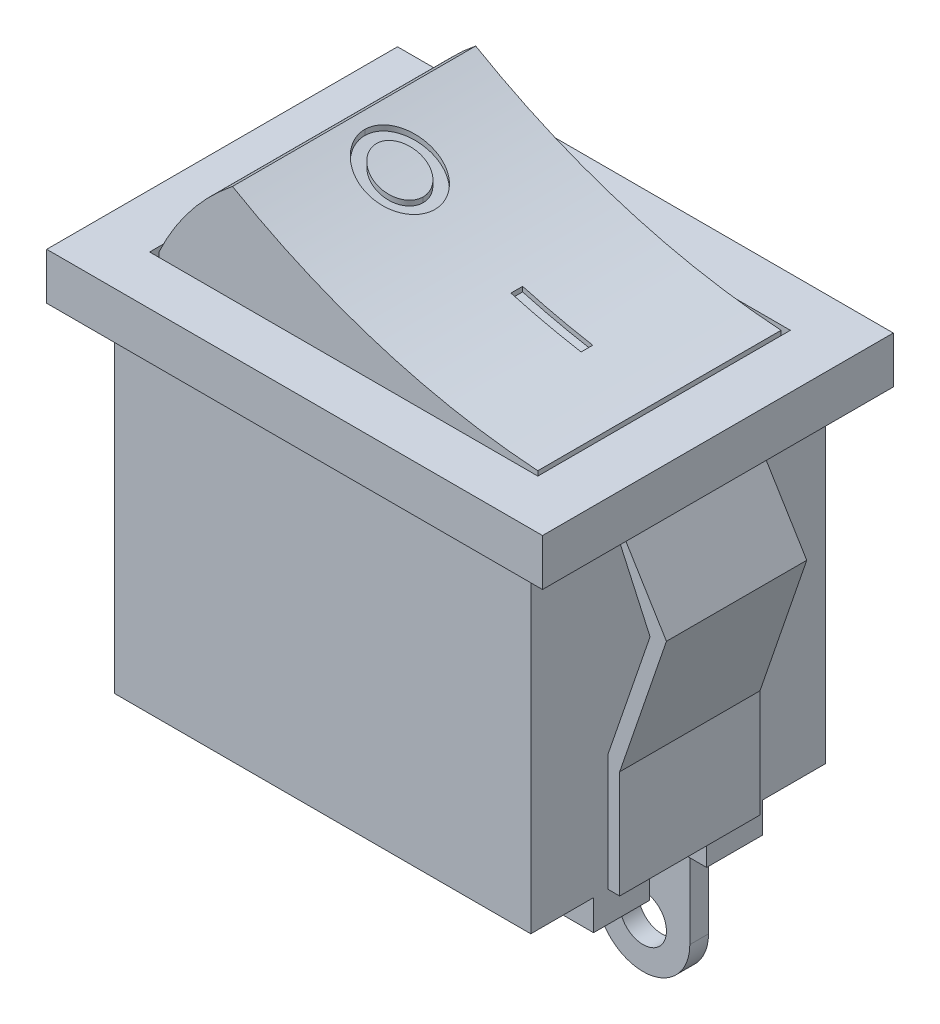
ISO-10303-21;
HEADER;
FILE_DESCRIPTION(('STEP AP214'),'2;1');
FILE_NAME('part.step','',(''),(''),'','','');
FILE_SCHEMA(('AUTOMOTIVE_DESIGN { 1 0 10303 214 1 1 1 1 }'));
ENDSEC;
DATA;
#1=APPLICATION_CONTEXT('core data for automotive mechanical design processes');
#2=APPLICATION_PROTOCOL_DEFINITION('international standard','automotive_design',2000,#1);
#3=PRODUCT_CONTEXT('',#1,'mechanical');
#4=PRODUCT('Part','Part','',(#3));
#5=PRODUCT_RELATED_PRODUCT_CATEGORY('part','',(#4));
#6=PRODUCT_DEFINITION_FORMATION('','',#4);
#7=PRODUCT_DEFINITION_CONTEXT('part definition',#1,'design');
#8=PRODUCT_DEFINITION('design','',#6,#7);
#9=PRODUCT_DEFINITION_SHAPE('','',#8);
#10=(LENGTH_UNIT() NAMED_UNIT(*) SI_UNIT(.MILLI.,.METRE.));
#11=(NAMED_UNIT(*) PLANE_ANGLE_UNIT() SI_UNIT($,.RADIAN.));
#12=(NAMED_UNIT(*) SI_UNIT($,.STERADIAN.) SOLID_ANGLE_UNIT());
#13=UNCERTAINTY_MEASURE_WITH_UNIT(LENGTH_MEASURE(1.E-05),#10,'distance_accuracy_value','');
#14=(GEOMETRIC_REPRESENTATION_CONTEXT(3) GLOBAL_UNCERTAINTY_ASSIGNED_CONTEXT((#13)) GLOBAL_UNIT_ASSIGNED_CONTEXT((#10,
#11,#12)) REPRESENTATION_CONTEXT('',''));
#15=CARTESIAN_POINT('',(0.,0.,0.));
#16=DIRECTION('',(0.,0.,1.));
#17=DIRECTION('',(1.,0.,0.));
#18=AXIS2_PLACEMENT_3D('',#15,#16,#17);
#19=CARTESIAN_POINT('',(27.12911314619,169.13129966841,-0.7));
#20=DIRECTION('',(0.,0.,-1.));
#21=DIRECTION('',(0.,-1.,0.));
#22=AXIS2_PLACEMENT_3D('',#19,#20,#21);
#23=CYLINDRICAL_SURFACE('',#22,30.);
#24=CARTESIAN_POINT('',(13.0000123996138,142.666823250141,-5.90000000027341));
#25=CARTESIAN_POINT('',(13.0000098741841,142.666824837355,-5.92581186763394));
#26=CARTESIAN_POINT('',(13.0010102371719,142.666290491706,-5.9516103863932));
#27=CARTESIAN_POINT('',(13.004992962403,142.664164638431,-6.00300219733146));
#28=CARTESIAN_POINT('',(13.0079747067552,142.662573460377,-6.02859555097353));
#29=CARTESIAN_POINT('',(13.0198191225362,142.656256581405,-6.10457943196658));
#30=CARTESIAN_POINT('',(13.0315814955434,142.6499872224,-6.15442584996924));
#31=CARTESIAN_POINT('',(13.062286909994,142.633663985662,-6.2511078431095));
#32=CARTESIAN_POINT('',(13.0812244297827,142.623613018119,-6.29794570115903));
#33=CARTESIAN_POINT('',(13.1255008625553,142.600195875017,-6.38761892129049));
#34=CARTESIAN_POINT('',(13.1508445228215,142.586827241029,-6.43045128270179));
#35=CARTESIAN_POINT('',(13.2083916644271,142.556600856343,-6.51322926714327));
#36=CARTESIAN_POINT('',(13.240868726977,142.539605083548,-6.55293333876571));
#37=CARTESIAN_POINT('',(13.310808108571,142.503194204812,-6.62638093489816));
#38=CARTESIAN_POINT('',(13.3482722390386,142.483778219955,-6.66012228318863));
#39=CARTESIAN_POINT('',(13.4315978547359,142.440842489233,-6.7246487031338));
#40=CARTESIAN_POINT('',(13.477929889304,142.417106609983,-6.75468232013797));
#41=CARTESIAN_POINT('',(13.5742413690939,142.368109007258,-6.80652130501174));
#42=CARTESIAN_POINT('',(13.6242223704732,142.342846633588,-6.82832313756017));
#43=CARTESIAN_POINT('',(13.7318681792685,142.288836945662,-6.86525885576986));
#44=CARTESIAN_POINT('',(13.78979753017,142.259996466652,-6.87948933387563));
#45=CARTESIAN_POINT('',(13.9071483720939,142.202060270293,-6.89748219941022));
#46=CARTESIAN_POINT('',(13.9665704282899,142.172964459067,-6.9012405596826));
#47=CARTESIAN_POINT('',(14.0884042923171,142.113810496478,-6.89807185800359));
#48=CARTESIAN_POINT('',(14.1508154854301,142.083777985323,-6.89059539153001));
#49=CARTESIAN_POINT('',(14.2737774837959,142.025119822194,-6.86388093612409));
#50=CARTESIAN_POINT('',(14.334328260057,141.996494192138,-6.84464276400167));
#51=CARTESIAN_POINT('',(14.4502951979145,141.942118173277,-6.79508705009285));
#52=CARTESIAN_POINT('',(14.5057940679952,141.916319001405,-6.76501804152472));
#53=CARTESIAN_POINT('',(14.6110129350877,141.867761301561,-6.69418330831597));
#54=CARTESIAN_POINT('',(14.6607360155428,141.845001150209,-6.65342332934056));
#55=CARTESIAN_POINT('',(14.7485479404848,141.805053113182,-6.56577029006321));
#56=CARTESIAN_POINT('',(14.7872493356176,141.787565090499,-6.51962887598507));
#57=CARTESIAN_POINT('',(14.8561915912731,141.756551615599,-6.42020382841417));
#58=CARTESIAN_POINT('',(14.8864354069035,141.743024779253,-6.36692269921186));
#59=CARTESIAN_POINT('',(14.9344912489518,141.721596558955,-6.26031438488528));
#60=CARTESIAN_POINT('',(14.953216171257,141.71328063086,-6.20747983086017));
#61=CARTESIAN_POINT('',(14.9815856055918,141.700699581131,-6.09902523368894));
#62=CARTESIAN_POINT('',(14.9912508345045,141.696425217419,-6.04341185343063));
#63=CARTESIAN_POINT('',(14.9974425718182,141.693687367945,-5.97286097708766));
#64=CARTESIAN_POINT('',(14.9983984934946,141.693264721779,-5.95829716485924));
#65=CARTESIAN_POINT('',(14.9996712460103,141.692702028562,-5.92915765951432));
#66=CARTESIAN_POINT('',(14.9999890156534,141.692561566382,-5.91458201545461));
#67=CARTESIAN_POINT('',(14.9999894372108,141.692561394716,-5.90000001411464));
#68=B_SPLINE_CURVE_WITH_KNOTS('',3,(#24,#25,#26,#27,#28,#29,#30,#31,#32,#33,#34,#35,#36,#37,#38,
#39,#40,#41,#42,#43,#44,#45,#46,#47,#48,#49,#50,#51,#52,#53,#54,#55,#56,#57,#58,#59,#60,#61,#62,
#63,#64,#65,#66,#67),.UNSPECIFIED.,.F.,.F.,(4,2,2,2,2,2,2,2,2,2,2,2,2,2,2,2,2,2,2,2,2,4),(0.,
0.0773845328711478,0.154744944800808,0.308719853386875,0.46257651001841,0.616547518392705,
0.778003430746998,0.939518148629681,1.11907793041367,1.29871474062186,1.49661710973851,
1.69459557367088,1.90257563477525,2.1105589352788,2.31404555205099,2.51742303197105,
2.70452813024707,2.89156777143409,3.06070317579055,3.22945086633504,3.27324444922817,
3.31697355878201),.UNSPECIFIED.);
#69=CARTESIAN_POINT('',(13.0000119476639,142.666823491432,-5.90000000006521));
#70=VERTEX_POINT('',#69);
#71=CARTESIAN_POINT('',(14.9999889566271,141.692561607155,-5.89999999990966));
#72=VERTEX_POINT('',#71);
#73=EDGE_CURVE('E20',#70,#72,#68,.T.);
#74=ORIENTED_EDGE('',*,*,#73,.F.);
#75=CARTESIAN_POINT('',(14.9999887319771,141.692561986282,-5.89999999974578));
#76=CARTESIAN_POINT('',(14.9999906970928,141.692561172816,-5.87363818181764));
#77=CARTESIAN_POINT('',(14.9989476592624,141.693021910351,-5.84728955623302));
#78=CARTESIAN_POINT('',(14.994792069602,141.694859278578,-5.79479363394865));
#79=CARTESIAN_POINT('',(14.9916799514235,141.69623571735,-5.76864629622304));
#80=CARTESIAN_POINT('',(14.9793011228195,141.701714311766,-5.69094701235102));
#81=CARTESIAN_POINT('',(14.9669915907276,141.707165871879,-5.63993721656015));
#82=CARTESIAN_POINT('',(14.9347728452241,141.721477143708,-5.54094269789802));
#83=CARTESIAN_POINT('',(14.9148658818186,141.730335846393,-5.49295708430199));
#84=CARTESIAN_POINT('',(14.8682281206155,141.751172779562,-5.40114870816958));
#85=CARTESIAN_POINT('',(14.8414946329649,141.763152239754,-5.3573275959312));
#86=CARTESIAN_POINT('',(14.7811857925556,141.790308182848,-5.27347340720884));
#87=CARTESIAN_POINT('',(14.7474155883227,141.805576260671,-5.2336106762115));
#88=CARTESIAN_POINT('',(14.674736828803,141.838624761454,-5.1601034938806));
#89=CARTESIAN_POINT('',(14.6358265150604,141.856406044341,-5.12646118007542));
#90=CARTESIAN_POINT('',(14.5506767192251,141.895563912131,-5.06343929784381));
#91=CARTESIAN_POINT('',(14.5040988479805,141.917115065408,-5.03462590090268));
#92=CARTESIAN_POINT('',(14.4076183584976,141.962081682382,-4.98520685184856));
#93=CARTESIAN_POINT('',(14.3577146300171,141.985497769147,-4.96460395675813));
#94=CARTESIAN_POINT('',(14.2512515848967,142.035830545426,-4.93029000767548));
#95=CARTESIAN_POINT('',(14.1944974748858,142.06287262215,-4.91736605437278));
#96=CARTESIAN_POINT('',(14.0800369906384,142.117865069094,-4.90150037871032));
#97=CARTESIAN_POINT('',(14.0223302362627,142.145815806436,-4.89856274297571));
#98=CARTESIAN_POINT('',(13.9034323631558,142.203878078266,-4.90274601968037));
#99=CARTESIAN_POINT('',(13.842273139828,142.234006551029,-4.91056925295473));
#100=CARTESIAN_POINT('',(13.7221351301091,142.293687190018,-4.93737692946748));
#101=CARTESIAN_POINT('',(13.6631569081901,142.323239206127,-4.95636424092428));
#102=CARTESIAN_POINT('',(13.5483763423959,142.381201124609,-5.00555120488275));
#103=CARTESIAN_POINT('',(13.4926226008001,142.409592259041,-5.03588732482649));
#104=CARTESIAN_POINT('',(13.3870081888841,142.463752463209,-5.10731614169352));
#105=CARTESIAN_POINT('',(13.3371457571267,142.489522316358,-5.14840561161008));
#106=CARTESIAN_POINT('',(13.2483722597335,142.535672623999,-5.23758692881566));
#107=CARTESIAN_POINT('',(13.2089615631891,142.556293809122,-5.2850542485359));
#108=CARTESIAN_POINT('',(13.1389686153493,142.593073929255,-5.38765992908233));
#109=CARTESIAN_POINT('',(13.1083810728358,142.609235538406,-5.4427936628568));
#110=CARTESIAN_POINT('',(13.0607992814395,142.634447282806,-5.55209496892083));
#111=CARTESIAN_POINT('',(13.0426278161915,142.64411107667,-5.60561054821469));
#112=CARTESIAN_POINT('',(13.0155541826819,142.65852695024,-5.71549913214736));
#113=CARTESIAN_POINT('',(13.0066259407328,142.663292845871,-5.77186362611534));
#114=CARTESIAN_POINT('',(13.0017112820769,142.665916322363,-5.84045290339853));
#115=CARTESIAN_POINT('',(13.0010732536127,142.666256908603,-5.85235887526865));
#116=CARTESIAN_POINT('',(13.0002238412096,142.666710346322,-5.87617495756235));
#117=CARTESIAN_POINT('',(13.0000119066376,142.666823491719,-5.88808504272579));
#118=CARTESIAN_POINT('',(13.0000114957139,142.666823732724,-5.89999999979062));
#119=B_SPLINE_CURVE_WITH_KNOTS('',3,(#75,#76,#77,#78,#79,#80,#81,#82,#83,#84,#85,#86,#87,#88,
#89,#90,#91,#92,#93,#94,#95,#96,#97,#98,#99,#100,#101,#102,#103,#104,#105,#106,#107,#108,#109,
#110,#111,#112,#113,#114,#115,#116,#117,#118),.UNSPECIFIED.,.F.,.F.,(4,2,2,2,2,2,2,2,2,2,2,2,2,
2,2,2,2,2,2,2,2,4),(0.,0.0790347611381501,0.158052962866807,0.315495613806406,0.472891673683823,
0.6303498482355,0.792947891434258,0.955601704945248,1.13143318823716,1.30732366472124,
1.49904347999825,1.69084174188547,1.89576949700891,2.10074992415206,2.30827886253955,
2.5157455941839,2.7097981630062,2.9037341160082,3.07481272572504,3.24540742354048,
3.28118636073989,3.3169190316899),.UNSPECIFIED.);
#120=EDGE_CURVE('E435',#72,#70,#119,.T.);
#121=ORIENTED_EDGE('',*,*,#120,.F.);
#122=EDGE_LOOP('',(#74,#121));
#123=FACE_BOUND('',#122,.T.);
#124=ADVANCED_FACE('F16',(#123),#23,.F.);
#125=CARTESIAN_POINT('',(14.000000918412,120.98,-5.90004441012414));
#126=DIRECTION('',(0.,-1.,0.));
#127=DIRECTION('',(0.,0.,1.));
#128=AXIS2_PLACEMENT_3D('',#125,#126,#127);
#129=CYLINDRICAL_SURFACE('',#128,0.9999885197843);
#130=DIRECTION('',(0.,-1.,0.));
#131=VECTOR('',#130,1.);
#132=CARTESIAN_POINT('',(13.0000114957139,120.98,-5.89999999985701));
#133=LINE('',#132,#131);
#134=CARTESIAN_POINT('',(13.0000119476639,142.440318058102,-5.90000000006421));
#135=VERTEX_POINT('',#134);
#136=EDGE_CURVE('E433',#70,#135,#133,.T.);
#137=ORIENTED_EDGE('',*,*,#136,.F.);
#138=ORIENTED_EDGE('',*,*,#73,.T.);
#139=DIRECTION('',(0.,-1.,0.));
#140=VECTOR('',#139,1.);
#141=CARTESIAN_POINT('',(14.9999884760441,120.98,-5.89999999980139));
#142=LINE('',#141,#140);
#143=CARTESIAN_POINT('',(14.9999884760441,141.474034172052,-5.89999999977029));
#144=VERTEX_POINT('',#143);
#145=EDGE_CURVE('E430',#144,#72,#142,.F.);
#146=ORIENTED_EDGE('',*,*,#145,.F.);
#147=CARTESIAN_POINT('',(14.9999892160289,141.474033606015,-5.90000000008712));
#148=CARTESIAN_POINT('',(14.9999914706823,141.474033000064,-5.92638603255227));
#149=CARTESIAN_POINT('',(14.9989466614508,141.474491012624,-5.95275886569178));
#150=CARTESIAN_POINT('',(14.9947834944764,141.476317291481,-6.00530320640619));
#151=CARTESIAN_POINT('',(14.99166556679,141.477685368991,-6.03147475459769));
#152=CARTESIAN_POINT('',(14.9792632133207,141.483130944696,-6.10924783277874));
#153=CARTESIAN_POINT('',(14.9669298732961,141.488549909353,-6.16030704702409));
#154=CARTESIAN_POINT('',(14.9346457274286,141.502776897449,-6.2593988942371));
#155=CARTESIAN_POINT('',(14.914697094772,141.511583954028,-6.30743238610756));
#156=CARTESIAN_POINT('',(14.8679571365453,141.532301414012,-6.39933090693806));
#157=CARTESIAN_POINT('',(14.8411631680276,141.544213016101,-6.44319431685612));
#158=CARTESIAN_POINT('',(14.7807239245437,141.571212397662,-6.52710778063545));
#159=CARTESIAN_POINT('',(14.7468856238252,141.586390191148,-6.56698931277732));
#160=CARTESIAN_POINT('',(14.6740551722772,141.619245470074,-6.64052291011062));
#161=CARTESIAN_POINT('',(14.635061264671,141.63692380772,-6.6741728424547));
#162=CARTESIAN_POINT('',(14.5497690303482,141.675836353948,-6.73715964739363));
#163=CARTESIAN_POINT('',(14.503136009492,141.697241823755,-6.76593700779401));
#164=CARTESIAN_POINT('',(14.4065399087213,141.74190455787,-6.81527539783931));
#165=CARTESIAN_POINT('',(14.356575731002,141.765162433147,-6.83583370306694));
#166=CARTESIAN_POINT('',(14.2500495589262,141.815123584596,-6.87001966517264));
#167=CARTESIAN_POINT('',(14.1932954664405,141.841949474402,-6.88287070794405));
#168=CARTESIAN_POINT('',(14.0788392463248,141.89649884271,-6.89859436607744));
#169=CARTESIAN_POINT('',(14.021136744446,141.924222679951,-6.90146294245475));
#170=CARTESIAN_POINT('',(13.9023202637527,141.981776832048,-6.89714129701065));
#171=CARTESIAN_POINT('',(13.8412381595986,142.011623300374,-6.88926084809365));
#172=CARTESIAN_POINT('',(13.7212616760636,142.070738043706,-6.86236586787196));
#173=CARTESIAN_POINT('',(13.6623678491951,142.100006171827,-6.84334854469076));
#174=CARTESIAN_POINT('',(13.5477888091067,142.157390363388,-6.79414422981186));
#175=CARTESIAN_POINT('',(13.4921505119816,142.185488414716,-6.7638260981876));
#176=CARTESIAN_POINT('',(13.3867625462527,142.239083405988,-6.69248375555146));
#177=CARTESIAN_POINT('',(13.3370111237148,142.264581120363,-6.65146274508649));
#178=CARTESIAN_POINT('',(13.2483993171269,142.310261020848,-6.56243524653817));
#179=CARTESIAN_POINT('',(13.2090461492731,142.330678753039,-6.51504260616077));
#180=CARTESIAN_POINT('',(13.1391477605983,142.367099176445,-6.4126271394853));
#181=CARTESIAN_POINT('',(13.1085974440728,142.383104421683,-6.35760875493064));
#182=CARTESIAN_POINT('',(13.0610030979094,142.408108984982,-6.24845241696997));
#183=CARTESIAN_POINT('',(13.0428030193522,142.417705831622,-6.19495341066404));
#184=CARTESIAN_POINT('',(13.0156684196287,142.432031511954,-6.0851020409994));
#185=CARTESIAN_POINT('',(13.0067080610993,142.436773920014,-6.02875809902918));
#186=CARTESIAN_POINT('',(13.0017428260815,142.439401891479,-5.96008043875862));
#187=CARTESIAN_POINT('',(13.0010932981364,142.439745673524,-5.94806795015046));
#188=CARTESIAN_POINT('',(13.0002285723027,142.440203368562,-5.92403860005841));
#189=CARTESIAN_POINT('',(13.0000128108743,142.440317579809,-5.91202176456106));
#190=CARTESIAN_POINT('',(13.0000123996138,142.440317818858,-5.90000000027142));
#191=B_SPLINE_CURVE_WITH_KNOTS('',3,(#147,#148,#149,#150,#151,#152,#153,#154,#155,#156,#157,
#158,#159,#160,#161,#162,#163,#164,#165,#166,#167,#168,#169,#170,#171,#172,#173,#174,#175,#176,
#177,#178,#179,#180,#181,#182,#183,#184,#185,#186,#187,#188,#189,#190),.UNSPECIFIED.,.F.,.F.,(4,
2,2,2,2,2,2,2,2,2,2,2,2,2,2,2,2,2,2,2,2,4),(0.,0.0791073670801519,0.15819832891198,
0.315790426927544,0.473337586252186,0.63094566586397,0.793634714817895,0.956379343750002,
1.13212856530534,1.30793599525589,1.49933952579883,1.69082049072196,1.89519320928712,
2.09961718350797,2.30649123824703,2.51330350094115,2.70690082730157,2.90038585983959,
3.07141442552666,3.2419634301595,3.27806328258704,3.31411620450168),.UNSPECIFIED.);
#192=EDGE_CURVE('E437',#144,#135,#191,.T.);
#193=ORIENTED_EDGE('',*,*,#192,.T.);
#194=EDGE_LOOP('',(#137,#138,#146,#193));
#195=FACE_BOUND('',#194,.T.);
#196=ADVANCED_FACE('F428',(#195),#129,.T.);
#197=CARTESIAN_POINT('',(13.999999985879,120.98,-5.89995564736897));
#198=DIRECTION('',(0.,-1.,0.));
#199=DIRECTION('',(0.,0.,1.));
#200=AXIS2_PLACEMENT_3D('',#197,#198,#199);
#201=CYLINDRICAL_SURFACE('',#200,0.9999884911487);
#202=ORIENTED_EDGE('',*,*,#145,.T.);
#203=ORIENTED_EDGE('',*,*,#120,.T.);
#204=ORIENTED_EDGE('',*,*,#136,.T.);
#205=CARTESIAN_POINT('',(13.0000114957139,142.440318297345,-5.89999999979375));
#206=CARTESIAN_POINT('',(13.0000089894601,142.440319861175,-5.87415607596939));
#207=CARTESIAN_POINT('',(13.0010118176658,142.439788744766,-5.84832549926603));
#208=CARTESIAN_POINT('',(13.0050045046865,142.437675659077,-5.79686948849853));
#209=CARTESIAN_POINT('',(13.0079937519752,142.436094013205,-5.77124399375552));
#210=CARTESIAN_POINT('',(13.0198686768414,142.429814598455,-5.69516184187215));
#211=CARTESIAN_POINT('',(13.0316620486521,142.423582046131,-5.64524939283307));
#212=CARTESIAN_POINT('',(13.0624525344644,142.407352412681,-5.54843685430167));
#213=CARTESIAN_POINT('',(13.0814442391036,142.397358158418,-5.50153453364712));
#214=CARTESIAN_POINT('',(13.1258530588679,142.374070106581,-5.41173982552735));
#215=CARTESIAN_POINT('',(13.151274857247,142.360773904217,-5.36885039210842));
#216=CARTESIAN_POINT('',(13.2089893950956,142.330716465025,-5.28599305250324));
#217=CARTESIAN_POINT('',(13.241553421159,142.313819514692,-5.24626428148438));
#218=CARTESIAN_POINT('',(13.3116848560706,142.277617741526,-5.17278187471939));
#219=CARTESIAN_POINT('',(13.3492540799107,142.258312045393,-5.13903041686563));
#220=CARTESIAN_POINT('',(13.4327536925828,142.215650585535,-5.07455397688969));
#221=CARTESIAN_POINT('',(13.4791492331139,142.192082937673,-5.04457157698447));
#222=CARTESIAN_POINT('',(13.5755897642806,142.14343341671,-4.99284443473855));
#223=CARTESIAN_POINT('',(13.6256362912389,142.118350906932,-4.97110318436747));
#224=CARTESIAN_POINT('',(13.7333373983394,142.064767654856,-4.9343365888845));
#225=CARTESIAN_POINT('',(13.7912520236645,142.036176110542,-4.92020160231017));
#226=CARTESIAN_POINT('',(13.9085604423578,141.978744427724,-4.90238943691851));
#227=CARTESIAN_POINT('',(13.967954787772,141.949904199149,-4.89871622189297));
#228=CARTESIAN_POINT('',(14.0896593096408,141.891302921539,-4.90204599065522));
#229=CARTESIAN_POINT('',(14.1519680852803,141.861567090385,-4.90958720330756));
#230=CARTESIAN_POINT('',(14.2747108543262,141.803494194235,-4.93639139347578));
#231=CARTESIAN_POINT('',(14.3351448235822,141.775157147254,-4.95565452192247));
#232=CARTESIAN_POINT('',(14.450880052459,141.72133079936,-5.00521499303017));
#233=CARTESIAN_POINT('',(14.5062637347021,141.695793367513,-5.03526617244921));
#234=CARTESIAN_POINT('',(14.6112554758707,141.647730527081,-5.10601355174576));
#235=CARTESIAN_POINT('',(14.6608665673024,141.625203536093,-5.14670412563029));
#236=CARTESIAN_POINT('',(14.7485346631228,141.58563917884,-5.23422107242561));
#237=CARTESIAN_POINT('',(14.7871944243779,141.568308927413,-5.28031009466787));
#238=CARTESIAN_POINT('',(14.856067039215,141.537572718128,-5.37960137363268));
#239=CARTESIAN_POINT('',(14.8862827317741,141.524165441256,-5.43280123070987));
#240=CARTESIAN_POINT('',(14.9343475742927,141.502902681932,-5.53931462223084));
#241=CARTESIAN_POINT('',(14.9530939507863,141.494643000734,-5.59214473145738));
#242=CARTESIAN_POINT('',(14.981506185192,141.482142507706,-5.70058790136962));
#243=CARTESIAN_POINT('',(14.9911926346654,141.477892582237,-5.7561943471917));
#244=CARTESIAN_POINT('',(14.9974182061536,141.475161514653,-5.82680578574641));
#245=CARTESIAN_POINT('',(14.9983829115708,141.474738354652,-5.84143611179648));
#246=CARTESIAN_POINT('',(14.9996673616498,141.474174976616,-5.87070886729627));
#247=CARTESIAN_POINT('',(14.9999880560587,141.474034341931,-5.88535124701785));
#248=CARTESIAN_POINT('',(14.9999884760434,141.474034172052,-5.90000001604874));
#249=B_SPLINE_CURVE_WITH_KNOTS('',3,(#205,#206,#207,#208,#209,#210,#211,#212,#213,#214,#215,
#216,#217,#218,#219,#220,#221,#222,#223,#224,#225,#226,#227,#228,#229,#230,#231,#232,#233,#234,
#235,#236,#237,#238,#239,#240,#241,#242,#243,#244,#245,#246,#247,#248),.UNSPECIFIED.,.F.,.F.,(4,
2,2,2,2,2,2,2,2,2,2,2,2,2,2,2,2,2,2,2,2,4),(0.,0.0774806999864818,0.154937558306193,
0.30911110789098,0.463169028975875,0.617339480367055,0.778911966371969,0.940543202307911,
1.11997361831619,1.29947997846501,1.49695896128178,1.69451275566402,1.90185900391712,
2.10920792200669,2.31209843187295,2.51488187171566,2.70166684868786,2.88838895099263,
3.05751003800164,3.22624580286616,3.27024003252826,3.31416933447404),.UNSPECIFIED.);
#250=EDGE_CURVE('E440',#135,#144,#249,.T.);
#251=ORIENTED_EDGE('',*,*,#250,.T.);
#252=EDGE_LOOP('',(#202,#203,#204,#251));
#253=FACE_BOUND('',#252,.T.);
#254=ADVANCED_FACE('F438',(#253),#201,.T.);
#255=CARTESIAN_POINT('',(27.12911314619,169.13129966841,-0.7));
#256=DIRECTION('',(0.,0.,-1.));
#257=DIRECTION('',(0.,-1.,0.));
#258=AXIS2_PLACEMENT_3D('',#255,#256,#257);
#259=CYLINDRICAL_SURFACE('',#258,30.2);
#260=ORIENTED_EDGE('',*,*,#192,.F.);
#261=ORIENTED_EDGE('',*,*,#250,.F.);
#262=EDGE_LOOP('',(#260,#261));
#263=FACE_BOUND('',#262,.T.);
#264=CARTESIAN_POINT('',(12.5000102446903,142.711054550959,-5.89999999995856));
#265=CARTESIAN_POINT('',(12.5000077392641,142.711056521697,-5.8614564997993));
#266=CARTESIAN_POINT('',(12.5014963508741,142.71023169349,-5.8229331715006));
#267=CARTESIAN_POINT('',(12.5074190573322,142.706953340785,-5.74619620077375));
#268=CARTESIAN_POINT('',(12.511852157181,142.70450036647,-5.70798245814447));
#269=CARTESIAN_POINT('',(12.529454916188,142.694768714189,-5.59455495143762));
#270=CARTESIAN_POINT('',(12.5469288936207,142.685116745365,-5.52015897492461));
#271=CARTESIAN_POINT('',(12.59251494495,142.660032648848,-5.37588216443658));
#272=CARTESIAN_POINT('',(12.6206175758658,142.644605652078,-5.30599738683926));
#273=CARTESIAN_POINT('',(12.6862933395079,142.608736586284,-5.17217960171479));
#274=CARTESIAN_POINT('',(12.7238742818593,142.588290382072,-5.10825156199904));
#275=CARTESIAN_POINT('',(12.8093445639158,142.542078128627,-4.98441994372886));
#276=CARTESIAN_POINT('',(12.8576707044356,142.516089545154,-4.92490249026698));
#277=CARTESIAN_POINT('',(12.961765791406,142.460533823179,-4.81472713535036));
#278=CARTESIAN_POINT('',(13.0175374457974,142.430965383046,-4.76407247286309));
#279=CARTESIAN_POINT('',(13.1420389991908,142.365514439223,-4.66676773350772));
#280=CARTESIAN_POINT('',(13.2115212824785,142.329298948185,-4.62130400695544));
#281=CARTESIAN_POINT('',(13.3560908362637,142.254720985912,-4.54273730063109));
#282=CARTESIAN_POINT('',(13.4311806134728,142.216357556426,-4.50963988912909));
#283=CARTESIAN_POINT('',(13.5931590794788,142.134503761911,-4.45342861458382));
#284=CARTESIAN_POINT('',(13.680466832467,142.090892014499,-4.43169233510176));
#285=CARTESIAN_POINT('',(13.8575222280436,142.003553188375,-4.40409168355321));
#286=CARTESIAN_POINT('',(13.9472707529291,141.95982607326,-4.39823313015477));
#287=CARTESIAN_POINT('',(14.1308947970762,141.871491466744,-4.40277735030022));
#288=CARTESIAN_POINT('',(14.224776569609,141.826931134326,-4.41391393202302));
#289=CARTESIAN_POINT('',(14.4098549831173,141.740226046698,-4.45397558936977));
#290=CARTESIAN_POINT('',(14.5010517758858,141.698081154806,-4.48289965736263));
#291=CARTESIAN_POINT('',(14.6750225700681,141.61867519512,-4.55723122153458));
#292=CARTESIAN_POINT('',(14.757966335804,141.581306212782,-4.60212333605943));
#293=CARTESIAN_POINT('',(14.9152504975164,141.511216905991,-4.70782609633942));
#294=CARTESIAN_POINT('',(14.9895957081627,141.47849397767,-4.76862777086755));
#295=CARTESIAN_POINT('',(15.1208184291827,141.421273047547,-4.89919000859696));
#296=CARTESIAN_POINT('',(15.1786257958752,141.396322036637,-4.96781635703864));
#297=CARTESIAN_POINT('',(15.2817056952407,141.352133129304,-5.11557785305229));
#298=CARTESIAN_POINT('',(15.3269818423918,141.332893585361,-5.19470996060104));
#299=CARTESIAN_POINT('',(15.3993910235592,141.302267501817,-5.35353258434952));
#300=CARTESIAN_POINT('',(15.4277784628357,141.29033518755,-5.43254906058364));
#301=CARTESIAN_POINT('',(15.470989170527,141.272213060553,-5.59475178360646));
#302=CARTESIAN_POINT('',(15.4858416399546,141.266010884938,-5.6779286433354));
#303=CARTESIAN_POINT('',(15.4957348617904,141.261880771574,-5.78472763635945));
#304=CARTESIAN_POINT('',(15.4973311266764,141.261214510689,-5.80776647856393));
#305=CARTESIAN_POINT('',(15.4994570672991,141.260327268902,-5.85386686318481));
#306=CARTESIAN_POINT('',(15.4999883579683,141.260105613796,-5.87692831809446));
#307=CARTESIAN_POINT('',(15.499989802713,141.26010503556,-5.90000000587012));
#308=B_SPLINE_CURVE_WITH_KNOTS('',3,(#264,#265,#266,#267,#268,#269,#270,#271,#272,#273,#274,
#275,#276,#277,#278,#279,#280,#281,#282,#283,#284,#285,#286,#287,#288,#289,#290,#291,#292,#293,
#294,#295,#296,#297,#298,#299,#300,#301,#302,#303,#304,#305,#306,#307),.UNSPECIFIED.,.F.,.F.,(4,
2,2,2,2,2,2,2,2,2,2,2,2,2,2,2,2,2,2,2,2,4),(0.,0.115553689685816,0.231068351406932,
0.460926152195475,0.690580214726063,0.920424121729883,1.16230568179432,1.40427545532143,
1.67492622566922,1.94569871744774,2.24433091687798,2.54307254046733,2.85508284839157,
3.1670754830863,3.4697966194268,3.77234742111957,4.05023703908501,4.32804641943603,
4.58117754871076,4.83376125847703,4.90305383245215,4.97224125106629),.UNSPECIFIED.);
#309=CARTESIAN_POINT('',(12.5000102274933,142.711054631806,-5.9));
#310=VERTEX_POINT('',#309);
#311=CARTESIAN_POINT('',(15.4999897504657,141.26010505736,-5.90000000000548));
#312=VERTEX_POINT('',#311);
#313=EDGE_CURVE('E873',#310,#312,#308,.T.);
#314=ORIENTED_EDGE('',*,*,#313,.T.);
#315=CARTESIAN_POINT('',(15.4999898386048,141.260105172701,-5.90000000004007));
#316=CARTESIAN_POINT('',(15.4999913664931,141.260104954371,-5.93976366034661));
#317=CARTESIAN_POINT('',(15.4984081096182,141.260764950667,-5.979507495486));
#318=CARTESIAN_POINT('',(15.4921016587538,141.263397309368,-6.05869414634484));
#319=CARTESIAN_POINT('',(15.487379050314,141.265369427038,-6.0981370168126));
#320=CARTESIAN_POINT('',(15.4685896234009,141.273223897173,-6.21537074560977));
#321=CARTESIAN_POINT('',(15.4499007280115,141.281044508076,-6.29234818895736));
#322=CARTESIAN_POINT('',(15.4009541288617,141.301621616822,-6.44175635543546));
#323=CARTESIAN_POINT('',(15.3706985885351,141.31437719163,-6.51418792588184));
#324=CARTESIAN_POINT('',(15.2997783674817,141.344462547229,-6.65274293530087));
#325=CARTESIAN_POINT('',(15.2591104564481,141.361793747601,-6.71886440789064));
#326=CARTESIAN_POINT('',(15.1675084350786,141.401125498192,-6.84507818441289));
#327=CARTESIAN_POINT('',(15.1163131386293,141.423245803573,-6.90494293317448));
#328=CARTESIAN_POINT('',(15.006140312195,141.471271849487,-7.01524045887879));
#329=CARTESIAN_POINT('',(14.9471602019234,141.49717884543,-7.06567009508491));
#330=CARTESIAN_POINT('',(14.8186193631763,141.554189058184,-7.15962493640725));
#331=CARTESIAN_POINT('',(14.7486003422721,141.585533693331,-7.20237583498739));
#332=CARTESIAN_POINT('',(14.6036763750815,141.651129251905,-7.27556423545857));
#333=CARTESIAN_POINT('',(14.5287699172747,141.685381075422,-7.30599790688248));
#334=CARTESIAN_POINT('',(14.3694346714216,141.759070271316,-7.35639624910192));
#335=CARTESIAN_POINT('',(14.2847400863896,141.798700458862,-7.37523965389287));
#336=CARTESIAN_POINT('',(14.1141080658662,141.879536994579,-7.39813402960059));
#337=CARTESIAN_POINT('',(14.0281701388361,141.920743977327,-7.40217898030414));
#338=CARTESIAN_POINT('',(13.8510502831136,142.006709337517,-7.39540025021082));
#339=CARTESIAN_POINT('',(13.7599296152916,142.051512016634,-7.38349968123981));
#340=CARTESIAN_POINT('',(13.5810779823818,142.14054693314,-7.34323191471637));
#341=CARTESIAN_POINT('',(13.4933480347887,142.184778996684,-7.31485981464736));
#342=CARTESIAN_POINT('',(13.3219881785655,142.272172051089,-7.2413323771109));
#343=CARTESIAN_POINT('',(13.2384789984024,142.31529256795,-7.19584529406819));
#344=CARTESIAN_POINT('',(13.0803180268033,142.397812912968,-7.08882024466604));
#345=CARTESIAN_POINT('',(13.0056643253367,142.43721354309,-7.027285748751));
#346=CARTESIAN_POINT('',(12.8723187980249,142.508204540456,-6.89334258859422));
#347=CARTESIAN_POINT('',(12.8129461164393,142.54011810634,-6.82178710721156));
#348=CARTESIAN_POINT('',(12.7075464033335,142.59713268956,-6.66700182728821));
#349=CARTESIAN_POINT('',(12.6615106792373,142.622238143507,-6.58377968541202));
#350=CARTESIAN_POINT('',(12.5901438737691,142.661319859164,-6.41899558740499));
#351=CARTESIAN_POINT('',(12.5629778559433,142.676277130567,-6.33845834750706));
#352=CARTESIAN_POINT('',(12.5226321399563,142.698531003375,-6.173051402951));
#353=CARTESIAN_POINT('',(12.5094113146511,142.705850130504,-6.08819521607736));
#354=CARTESIAN_POINT('',(12.5023618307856,142.709752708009,-5.98573328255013));
#355=CARTESIAN_POINT('',(12.501479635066,142.710241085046,-5.96859092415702));
#356=CARTESIAN_POINT('',(12.5003047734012,142.710891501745,-5.93430133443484));
#357=CARTESIAN_POINT('',(12.5000113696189,142.71105394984,-5.91715413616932));
#358=CARTESIAN_POINT('',(12.5000101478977,142.711054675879,-5.90000000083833));
#359=B_SPLINE_CURVE_WITH_KNOTS('',3,(#315,#316,#317,#318,#319,#320,#321,#322,#323,#324,#325,
#326,#327,#328,#329,#330,#331,#332,#333,#334,#335,#336,#337,#338,#339,#340,#341,#342,#343,#344,
#345,#346,#347,#348,#349,#350,#351,#352,#353,#354,#355,#356,#357,#358),.UNSPECIFIED.,.F.,.F.,(4,
2,2,2,2,2,2,2,2,2,2,2,2,2,2,2,2,2,2,2,2,4),(0.,0.119214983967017,0.238407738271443,
0.475959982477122,0.713467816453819,0.9510494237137,1.19545093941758,1.43993366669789,
1.70229007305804,1.96472800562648,2.24966611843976,2.53472013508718,2.84002821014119,
3.14542720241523,3.45707929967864,3.76866405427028,4.06190990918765,4.3549642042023,
4.61244584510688,4.86916597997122,4.92067581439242,4.97212105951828),.UNSPECIFIED.);
#360=EDGE_CURVE('E870',#312,#310,#359,.T.);
#361=ORIENTED_EDGE('',*,*,#360,.T.);
#362=EDGE_LOOP('',(#314,#361));
#363=FACE_BOUND('',#362,.T.);
#364=ADVANCED_FACE('F901',(#263,#363),#259,.F.);
#365=CARTESIAN_POINT('',(27.12911314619,169.13129966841,-0.7));
#366=DIRECTION('',(0.,0.,-1.));
#367=DIRECTION('',(0.,-1.,0.));
#368=AXIS2_PLACEMENT_3D('',#365,#366,#367);
#369=CYLINDRICAL_SURFACE('',#368,30.2);
#370=DIRECTION('',(0.,0.,-1.));
#371=VECTOR('',#370,1.);
#372=CARTESIAN_POINT('',(22.,139.370046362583,-6.15));
#373=LINE('',#372,#371);
#374=CARTESIAN_POINT('',(22.,139.370046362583,-6.15));
#375=VERTEX_POINT('',#374);
#376=CARTESIAN_POINT('',(22.,139.370046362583,-5.65));
#377=VERTEX_POINT('',#376);
#378=EDGE_CURVE('E863',#375,#377,#373,.F.);
#379=ORIENTED_EDGE('',*,*,#378,.F.);
#380=CARTESIAN_POINT('',(27.12911314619,169.13129966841,-6.15));
#381=DIRECTION('',(0.,0.,-1.));
#382=DIRECTION('',(0.,-1.,0.));
#383=AXIS2_PLACEMENT_3D('',#380,#381,#382);
#384=CIRCLE('',#383,30.2);
#385=CARTESIAN_POINT('',(19.,140.045950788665,-6.15));
#386=VERTEX_POINT('',#385);
#387=EDGE_CURVE('E854',#386,#375,#384,.F.);
#388=ORIENTED_EDGE('',*,*,#387,.F.);
#389=DIRECTION('',(0.,0.,-1.));
#390=VECTOR('',#389,1.);
#391=CARTESIAN_POINT('',(19.,140.045950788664,-5.65));
#392=LINE('',#391,#390);
#393=CARTESIAN_POINT('',(19.,140.045950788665,-5.65));
#394=VERTEX_POINT('',#393);
#395=EDGE_CURVE('E445',#394,#386,#392,.T.);
#396=ORIENTED_EDGE('',*,*,#395,.F.);
#397=CARTESIAN_POINT('',(27.12911314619,169.13129966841,-5.65));
#398=DIRECTION('',(0.,0.,-1.));
#399=DIRECTION('',(0.,-1.,0.));
#400=AXIS2_PLACEMENT_3D('',#397,#398,#399);
#401=CIRCLE('',#400,30.2);
#402=EDGE_CURVE('E867',#377,#394,#401,.T.);
#403=ORIENTED_EDGE('',*,*,#402,.F.);
#404=EDGE_LOOP('',(#379,#388,#396,#403));
#405=FACE_BOUND('',#404,.T.);
#406=ADVANCED_FACE('F881',(#405),#369,.F.);
#407=CARTESIAN_POINT('',(14.000000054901,120.98,-5.89998704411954));
#408=DIRECTION('',(0.,-1.,0.));
#409=DIRECTION('',(0.,0.,1.));
#410=AXIS2_PLACEMENT_3D('',#407,#408,#409);
#411=CYLINDRICAL_SURFACE('',#410,1.499989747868);
#412=ORIENTED_EDGE('',*,*,#313,.F.);
#413=DIRECTION('',(0.,-1.,0.));
#414=VECTOR('',#413,1.);
#415=CARTESIAN_POINT('',(12.5000101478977,120.98,-5.90000000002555));
#416=LINE('',#415,#414);
#417=CARTESIAN_POINT('',(12.5000101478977,142.939901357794,-5.90000000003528));
#418=VERTEX_POINT('',#417);
#419=EDGE_CURVE('E868',#310,#418,#416,.F.);
#420=ORIENTED_EDGE('',*,*,#419,.T.);
#421=CARTESIAN_POINT('',(12.5000103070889,142.939901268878,-5.89999999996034));
#422=CARTESIAN_POINT('',(12.5000077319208,142.939903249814,-5.8615078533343));
#423=CARTESIAN_POINT('',(12.5014924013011,142.93907339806,-5.82303588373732));
#424=CARTESIAN_POINT('',(12.5073992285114,142.935775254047,-5.7464017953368));
#425=CARTESIAN_POINT('',(12.5118203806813,142.933307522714,-5.70823957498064));
#426=CARTESIAN_POINT('',(12.5293745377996,142.923517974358,-5.59496970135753));
#427=CARTESIAN_POINT('',(12.5467991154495,142.913809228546,-5.52067973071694));
#428=CARTESIAN_POINT('',(12.5922496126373,142.888581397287,-5.37661271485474));
#429=CARTESIAN_POINT('',(12.6202659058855,142.873067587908,-5.30683163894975));
#430=CARTESIAN_POINT('',(12.6857309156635,142.837001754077,-5.17320939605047));
#431=CARTESIAN_POINT('',(12.7231875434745,142.8164455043,-5.10937327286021));
#432=CARTESIAN_POINT('',(12.8083915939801,142.769975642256,-4.98566969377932));
#433=CARTESIAN_POINT('',(12.8565793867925,142.743835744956,-4.92619218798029));
#434=CARTESIAN_POINT('',(12.960369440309,142.687960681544,-4.81607344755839));
#435=CARTESIAN_POINT('',(13.0159744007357,142.658224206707,-4.76543544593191));
#436=CARTESIAN_POINT('',(13.1402012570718,142.592349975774,-4.66805010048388));
#437=CARTESIAN_POINT('',(13.209584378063,142.555872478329,-4.62250329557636));
#438=CARTESIAN_POINT('',(13.3539538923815,142.480753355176,-4.54375585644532));
#439=CARTESIAN_POINT('',(13.428942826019,142.442110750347,-4.51056086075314));
#440=CARTESIAN_POINT('',(13.5908406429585,142.359593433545,-4.45407832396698));
#441=CARTESIAN_POINT('',(13.6781761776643,142.315594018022,-4.43218899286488));
#442=CARTESIAN_POINT('',(13.855310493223,142.227471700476,-4.40430029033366));
#443=CARTESIAN_POINT('',(13.9451101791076,142.183348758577,-4.39830683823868));
#444=CARTESIAN_POINT('',(14.1289468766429,142.094166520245,-4.40259926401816));
#445=CARTESIAN_POINT('',(14.2229915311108,142.049155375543,-4.41363502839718));
#446=CARTESIAN_POINT('',(14.4084202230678,141.961564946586,-4.45355943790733));
#447=CARTESIAN_POINT('',(14.4998044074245,141.918985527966,-4.48244709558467));
#448=CARTESIAN_POINT('',(14.6741331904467,141.838765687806,-4.55677417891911));
#449=CARTESIAN_POINT('',(14.7572486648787,141.80101547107,-4.60169146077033));
#450=CARTESIAN_POINT('',(14.9148721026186,141.730208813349,-4.7075218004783));
#451=CARTESIAN_POINT('',(14.9893849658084,141.697149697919,-4.76842568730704));
#452=CARTESIAN_POINT('',(15.120818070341,141.639381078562,-4.89918268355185));
#453=CARTESIAN_POINT('',(15.1786835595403,141.614207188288,-4.96787932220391));
#454=CARTESIAN_POINT('',(15.2818617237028,141.569626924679,-5.11582135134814));
#455=CARTESIAN_POINT('',(15.327178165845,141.550218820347,-5.19506356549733));
#456=CARTESIAN_POINT('',(15.3995774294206,141.519356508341,-5.35401206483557));
#457=CARTESIAN_POINT('',(15.4279363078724,141.507342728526,-5.43303165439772));
#458=CARTESIAN_POINT('',(15.4710910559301,141.489102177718,-5.59524425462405));
#459=CARTESIAN_POINT('',(15.4859162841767,141.482862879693,-5.67842781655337));
#460=CARTESIAN_POINT('',(15.4957659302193,141.478718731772,-5.78514851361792));
#461=CARTESIAN_POINT('',(15.4973505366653,141.478052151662,-5.80810336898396));
#462=CARTESIAN_POINT('',(15.4994609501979,141.477164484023,-5.85403547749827));
#463=CARTESIAN_POINT('',(15.4999883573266,141.476942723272,-5.87701264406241));
#464=CARTESIAN_POINT('',(15.499989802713,141.476942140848,-5.90000000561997));
#465=B_SPLINE_CURVE_WITH_KNOTS('',3,(#421,#422,#423,#424,#425,#426,#427,#428,#429,#430,#431,
#432,#433,#434,#435,#436,#437,#438,#439,#440,#441,#442,#443,#444,#445,#446,#447,#448,#449,#450,
#451,#452,#453,#454,#455,#456,#457,#458,#459,#460,#461,#462,#463,#464),.UNSPECIFIED.,.F.,.F.,(4,
2,2,2,2,2,2,2,2,2,2,2,2,2,2,2,2,2,2,2,2,4),(0.,0.115399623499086,0.230759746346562,
0.460299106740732,0.689630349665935,0.919154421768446,1.16084957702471,1.40263294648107,
1.67349766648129,1.94448588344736,2.24379853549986,2.54322263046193,2.85621301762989,
3.16918609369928,3.47277696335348,3.77619405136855,4.05452124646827,4.33276479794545,
4.5859085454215,4.8385018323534,4.90754097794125,4.97647555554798),.UNSPECIFIED.);
#466=CARTESIAN_POINT('',(15.4999897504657,141.476942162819,-5.90000000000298));
#467=VERTEX_POINT('',#466);
#468=EDGE_CURVE('E511',#418,#467,#465,.T.);
#469=ORIENTED_EDGE('',*,*,#468,.T.);
#470=DIRECTION('',(0.,-1.,0.));
#471=VECTOR('',#470,1.);
#472=CARTESIAN_POINT('',(15.4999896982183,120.98,-5.90000000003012));
#473=LINE('',#472,#471);
#474=EDGE_CURVE('E871',#467,#312,#473,.T.);
#475=ORIENTED_EDGE('',*,*,#474,.T.);
#476=EDGE_LOOP('',(#412,#420,#469,#475));
#477=FACE_BOUND('',#476,.T.);
#478=ADVANCED_FACE('F552',(#477),#411,.F.);
#479=CARTESIAN_POINT('',(13.999999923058,120.98,-5.90001292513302));
#480=DIRECTION('',(0.,-1.,0.));
#481=DIRECTION('',(0.,0.,1.));
#482=AXIS2_PLACEMENT_3D('',#479,#480,#481);
#483=CYLINDRICAL_SURFACE('',#482,1.499989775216);
#484=ORIENTED_EDGE('',*,*,#360,.F.);
#485=ORIENTED_EDGE('',*,*,#474,.F.);
#486=CARTESIAN_POINT('',(15.4999898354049,141.476942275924,-5.90000000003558));
#487=CARTESIAN_POINT('',(15.4999913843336,141.476942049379,-5.93972999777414));
#488=CARTESIAN_POINT('',(15.4984107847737,141.477606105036,-5.97944017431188));
#489=CARTESIAN_POINT('',(15.4921150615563,141.480254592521,-6.05855950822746));
#490=CARTESIAN_POINT('',(15.4874005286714,141.482238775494,-6.09796872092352));
#491=CARTESIAN_POINT('',(15.4686438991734,141.490141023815,-6.21509994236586));
#492=CARTESIAN_POINT('',(15.4499882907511,141.498008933,-6.29200879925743));
#493=CARTESIAN_POINT('',(15.4011330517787,141.518708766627,-6.44128202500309));
#494=CARTESIAN_POINT('',(15.3709356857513,141.531539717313,-6.51364728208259));
#495=CARTESIAN_POINT('',(15.3001583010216,141.561800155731,-6.65207743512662));
#496=CARTESIAN_POINT('',(15.2595749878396,141.579231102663,-6.71814032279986));
#497=CARTESIAN_POINT('',(15.1681559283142,141.618792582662,-6.84427147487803));
#498=CARTESIAN_POINT('',(15.1170564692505,141.641044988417,-6.90410968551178));
#499=CARTESIAN_POINT('',(15.0070977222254,141.68935464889,-7.01436975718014));
#500=CARTESIAN_POINT('',(14.9482358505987,141.71541317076,-7.06478846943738));
#501=CARTESIAN_POINT('',(14.8198985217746,141.77278136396,-7.158790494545));
#502=CARTESIAN_POINT('',(14.7499597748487,141.804337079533,-7.20159029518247));
#503=CARTESIAN_POINT('',(14.6052054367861,141.870373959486,-7.27488920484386));
#504=CARTESIAN_POINT('',(14.5303883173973,141.904856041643,-7.30538443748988));
#505=CARTESIAN_POINT('',(14.3711512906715,141.979084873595,-7.35596128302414));
#506=CARTESIAN_POINT('',(14.2864620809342,142.019028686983,-7.37490678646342));
#507=CARTESIAN_POINT('',(14.115837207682,142.100509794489,-7.39800191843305));
#508=CARTESIAN_POINT('',(14.0299010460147,142.142047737,-7.40214546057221));
#509=CARTESIAN_POINT('',(13.852676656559,142.228759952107,-7.39556736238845));
#510=CARTESIAN_POINT('',(13.7614500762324,142.273980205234,-7.3837506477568));
#511=CARTESIAN_POINT('',(13.5823781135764,142.363856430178,-7.34361461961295));
#512=CARTESIAN_POINT('',(13.4945337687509,142.408512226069,-7.31529028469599));
#513=CARTESIAN_POINT('',(13.3228841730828,142.496781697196,-7.241795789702));
#514=CARTESIAN_POINT('',(13.2392029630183,142.540353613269,-7.19628338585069));
#515=CARTESIAN_POINT('',(13.0807047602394,142.623748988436,-7.08913333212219));
#516=CARTESIAN_POINT('',(13.0058858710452,142.663573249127,-7.0274991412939));
#517=CARTESIAN_POINT('',(12.8722897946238,142.735307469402,-6.89332205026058));
#518=CARTESIAN_POINT('',(12.8128230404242,142.767547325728,-6.82164632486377));
#519=CARTESIAN_POINT('',(12.7072685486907,142.825140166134,-6.66655379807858));
#520=CARTESIAN_POINT('',(12.6611717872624,142.850497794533,-6.58314497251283));
#521=CARTESIAN_POINT('',(12.5898222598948,142.889910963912,-6.41812182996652));
#522=CARTESIAN_POINT('',(12.5627006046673,142.904974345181,-6.33755356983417));
#523=CARTESIAN_POINT('',(12.5224513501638,142.927369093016,-6.1720773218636));
#524=CARTESIAN_POINT('',(12.5092822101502,142.934723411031,-6.08718300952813));
#525=CARTESIAN_POINT('',(12.5023141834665,142.938614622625,-5.98486136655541));
#526=CARTESIAN_POINT('',(12.5014498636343,142.939097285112,-5.96789316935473));
#527=CARTESIAN_POINT('',(12.500298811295,142.939740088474,-5.93395224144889));
#528=CARTESIAN_POINT('',(12.5000113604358,142.939900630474,-5.91697954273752));
#529=CARTESIAN_POINT('',(12.5000101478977,142.939901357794,-5.90000000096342));
#530=B_SPLINE_CURVE_WITH_KNOTS('',3,(#486,#487,#488,#489,#490,#491,#492,#493,#494,#495,#496,
#497,#498,#499,#500,#501,#502,#503,#504,#505,#506,#507,#508,#509,#510,#511,#512,#513,#514,#515,
#516,#517,#518,#519,#520,#521,#522,#523,#524,#525,#526,#527,#528,#529),.UNSPECIFIED.,.F.,.F.,(4,
2,2,2,2,2,2,2,2,2,2,2,2,2,2,2,2,2,2,2,2,4),(0.,0.119114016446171,0.238205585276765,
0.475550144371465,0.7128481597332,0.950221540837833,1.19449446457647,1.43884889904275,
1.70131289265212,1.96385950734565,2.24923608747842,2.53472999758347,2.84084041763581,
3.14704400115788,3.45969688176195,3.77228273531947,4.06627133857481,4.36006105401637,
4.61763800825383,4.8744459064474,4.92543117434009,4.97635291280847),.UNSPECIFIED.);
#531=EDGE_CURVE('E502',#467,#418,#530,.T.);
#532=ORIENTED_EDGE('',*,*,#531,.T.);
#533=ORIENTED_EDGE('',*,*,#419,.F.);
#534=EDGE_LOOP('',(#484,#485,#532,#533));
#535=FACE_BOUND('',#534,.T.);
#536=ADVANCED_FACE('F518',(#535),#483,.F.);
#537=CARTESIAN_POINT('',(19.,120.98,-5.65));
#538=DIRECTION('',(1.,0.,0.));
#539=DIRECTION('',(0.,-1.,0.));
#540=AXIS2_PLACEMENT_3D('',#537,#538,#539);
#541=PLANE('',#540);
#542=DIRECTION('',(0.,1.,0.));
#543=VECTOR('',#542,1.);
#544=CARTESIAN_POINT('',(19.,120.98,-6.15));
#545=LINE('',#544,#543);
#546=CARTESIAN_POINT('',(19.,140.253669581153,-6.15));
#547=VERTEX_POINT('',#546);
#548=EDGE_CURVE('E855',#547,#386,#545,.F.);
#549=ORIENTED_EDGE('',*,*,#548,.F.);
#550=DIRECTION('',(0.,0.,-1.));
#551=VECTOR('',#550,1.);
#552=CARTESIAN_POINT('',(19.0000000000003,140.253669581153,-0.7));
#553=LINE('',#552,#551);
#554=CARTESIAN_POINT('',(19.,140.253669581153,-5.65));
#555=VERTEX_POINT('',#554);
#556=EDGE_CURVE('E501',#547,#555,#553,.F.);
#557=ORIENTED_EDGE('',*,*,#556,.T.);
#558=DIRECTION('',(0.,-1.,0.));
#559=VECTOR('',#558,1.);
#560=CARTESIAN_POINT('',(19.,120.98,-5.65));
#561=LINE('',#560,#559);
#562=EDGE_CURVE('E864',#394,#555,#561,.F.);
#563=ORIENTED_EDGE('',*,*,#562,.F.);
#564=ORIENTED_EDGE('',*,*,#395,.T.);
#565=EDGE_LOOP('',(#549,#557,#563,#564));
#566=FACE_BOUND('',#565,.T.);
#567=ADVANCED_FACE('F544',(#566),#541,.T.);
#568=CARTESIAN_POINT('',(22.,120.98,-5.65));
#569=DIRECTION('',(0.,0.,-1.));
#570=DIRECTION('',(0.,-1.,0.));
#571=AXIS2_PLACEMENT_3D('',#568,#569,#570);
#572=PLANE('',#571);
#573=ORIENTED_EDGE('',*,*,#562,.T.);
#574=CARTESIAN_POINT('',(27.12911314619,169.13129966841,-5.65));
#575=DIRECTION('',(0.,0.,-1.));
#576=DIRECTION('',(0.,-1.,0.));
#577=AXIS2_PLACEMENT_3D('',#574,#575,#576);
#578=CIRCLE('',#577,30.);
#579=CARTESIAN_POINT('',(22.,139.573014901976,-5.65));
#580=VERTEX_POINT('',#579);
#581=EDGE_CURVE('E499',#555,#580,#578,.F.);
#582=ORIENTED_EDGE('',*,*,#581,.T.);
#583=DIRECTION('',(0.,1.,0.));
#584=VECTOR('',#583,1.);
#585=CARTESIAN_POINT('',(22.,120.98,-5.65));
#586=LINE('',#585,#584);
#587=EDGE_CURVE('E858',#377,#580,#586,.T.);
#588=ORIENTED_EDGE('',*,*,#587,.F.);
#589=ORIENTED_EDGE('',*,*,#402,.T.);
#590=EDGE_LOOP('',(#573,#582,#588,#589));
#591=FACE_BOUND('',#590,.T.);
#592=ADVANCED_FACE('F541',(#591),#572,.T.);
#593=CARTESIAN_POINT('',(22.,120.98,-6.15));
#594=DIRECTION('',(-1.,0.,0.));
#595=DIRECTION('',(0.,1.,0.));
#596=AXIS2_PLACEMENT_3D('',#593,#594,#595);
#597=PLANE('',#596);
#598=ORIENTED_EDGE('',*,*,#587,.T.);
#599=DIRECTION('',(0.,0.,-1.));
#600=VECTOR('',#599,1.);
#601=CARTESIAN_POINT('',(22.,139.573014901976,-0.7));
#602=LINE('',#601,#600);
#603=CARTESIAN_POINT('',(22.,139.573014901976,-6.15));
#604=VERTEX_POINT('',#603);
#605=EDGE_CURVE('E498',#580,#604,#602,.T.);
#606=ORIENTED_EDGE('',*,*,#605,.T.);
#607=DIRECTION('',(0.,1.,0.));
#608=VECTOR('',#607,1.);
#609=CARTESIAN_POINT('',(22.,120.98,-6.15));
#610=LINE('',#609,#608);
#611=EDGE_CURVE('E839',#375,#604,#610,.T.);
#612=ORIENTED_EDGE('',*,*,#611,.F.);
#613=ORIENTED_EDGE('',*,*,#378,.T.);
#614=EDGE_LOOP('',(#598,#606,#612,#613));
#615=FACE_BOUND('',#614,.T.);
#616=ADVANCED_FACE('F537',(#615),#597,.T.);
#617=CARTESIAN_POINT('',(19.,120.98,-6.15));
#618=DIRECTION('',(0.,0.,1.));
#619=DIRECTION('',(0.,1.,0.));
#620=AXIS2_PLACEMENT_3D('',#617,#618,#619);
#621=PLANE('',#620);
#622=ORIENTED_EDGE('',*,*,#611,.T.);
#623=CARTESIAN_POINT('',(27.12911314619,169.13129966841,-6.15));
#624=DIRECTION('',(0.,0.,-1.));
#625=DIRECTION('',(0.,-1.,0.));
#626=AXIS2_PLACEMENT_3D('',#623,#624,#625);
#627=CIRCLE('',#626,30.);
#628=EDGE_CURVE('E495',#604,#547,#627,.T.);
#629=ORIENTED_EDGE('',*,*,#628,.T.);
#630=ORIENTED_EDGE('',*,*,#548,.T.);
#631=ORIENTED_EDGE('',*,*,#387,.T.);
#632=EDGE_LOOP('',(#622,#629,#630,#631));
#633=FACE_BOUND('',#632,.T.);
#634=ADVANCED_FACE('F533',(#633),#621,.T.);
#635=CARTESIAN_POINT('',(18.886,134.586996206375,-0.7));
#636=DIRECTION('',(0.,0.,-1.));
#637=DIRECTION('',(0.,-1.,0.));
#638=AXIS2_PLACEMENT_3D('',#635,#636,#637);
#639=CYLINDRICAL_SURFACE('',#638,11.);
#640=CARTESIAN_POINT('',(18.886,134.586996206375,-11.1));
#641=DIRECTION('',(0.,0.,-1.));
#642=DIRECTION('',(0.,-1.,0.));
#643=AXIS2_PLACEMENT_3D('',#640,#641,#642);
#644=CIRCLE('',#643,11.);
#645=CARTESIAN_POINT('',(8.9,139.2,-11.1));
#646=VERTEX_POINT('',#645);
#647=CARTESIAN_POINT('',(12.0437660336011,143.200000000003,-11.1));
#648=VERTEX_POINT('',#647);
#649=EDGE_CURVE('E486',#646,#648,#644,.T.);
#650=ORIENTED_EDGE('',*,*,#649,.F.);
#651=DIRECTION('',(0.,0.,-1.));
#652=VECTOR('',#651,1.);
#653=CARTESIAN_POINT('',(8.9,139.2,-0.7));
#654=LINE('',#653,#652);
#655=CARTESIAN_POINT('',(8.9,139.2,-0.7));
#656=VERTEX_POINT('',#655);
#657=EDGE_CURVE('E494',#646,#656,#654,.F.);
#658=ORIENTED_EDGE('',*,*,#657,.T.);
#659=CARTESIAN_POINT('',(18.886,134.586996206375,-0.7));
#660=DIRECTION('',(0.,0.,-1.));
#661=DIRECTION('',(0.,-1.,0.));
#662=AXIS2_PLACEMENT_3D('',#659,#660,#661);
#663=CIRCLE('',#662,11.);
#664=CARTESIAN_POINT('',(12.0437660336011,143.200000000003,-0.7));
#665=VERTEX_POINT('',#664);
#666=EDGE_CURVE('E483',#656,#665,#663,.T.);
#667=ORIENTED_EDGE('',*,*,#666,.T.);
#668=DIRECTION('',(0.,0.,-1.));
#669=VECTOR('',#668,1.);
#670=CARTESIAN_POINT('',(12.0437660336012,143.200000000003,-0.7));
#671=LINE('',#670,#669);
#672=EDGE_CURVE('E837',#665,#648,#671,.T.);
#673=ORIENTED_EDGE('',*,*,#672,.T.);
#674=EDGE_LOOP('',(#650,#658,#667,#673));
#675=FACE_BOUND('',#674,.T.);
#676=ADVANCED_FACE('F527',(#675),#639,.T.);
#677=CARTESIAN_POINT('',(27.12911314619,169.13129966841,-0.7));
#678=DIRECTION('',(0.,0.,-1.));
#679=DIRECTION('',(0.,-1.,0.));
#680=AXIS2_PLACEMENT_3D('',#677,#678,#679);
#681=CYLINDRICAL_SURFACE('',#680,30.);
#682=ORIENTED_EDGE('',*,*,#605,.F.);
#683=ORIENTED_EDGE('',*,*,#581,.F.);
#684=ORIENTED_EDGE('',*,*,#556,.F.);
#685=ORIENTED_EDGE('',*,*,#628,.F.);
#686=EDGE_LOOP('',(#682,#683,#684,#685));
#687=FACE_BOUND('',#686,.T.);
#688=ORIENTED_EDGE('',*,*,#468,.F.);
#689=ORIENTED_EDGE('',*,*,#531,.F.);
#690=EDGE_LOOP('',(#688,#689));
#691=FACE_BOUND('',#690,.T.);
#692=ORIENTED_EDGE('',*,*,#672,.F.);
#693=CARTESIAN_POINT('',(27.12911314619,169.13129966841,-0.7));
#694=DIRECTION('',(0.,0.,-1.));
#695=DIRECTION('',(0.,-1.,0.));
#696=AXIS2_PLACEMENT_3D('',#693,#694,#695);
#697=CIRCLE('',#696,30.);
#698=CARTESIAN_POINT('',(25.1,139.200000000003,-0.7));
#699=VERTEX_POINT('',#698);
#700=EDGE_CURVE('E480',#665,#699,#697,.F.);
#701=ORIENTED_EDGE('',*,*,#700,.T.);
#702=DIRECTION('',(0.,0.,-1.));
#703=VECTOR('',#702,1.);
#704=CARTESIAN_POINT('',(25.1,139.200000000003,-11.1));
#705=LINE('',#704,#703);
#706=CARTESIAN_POINT('',(25.1,139.200000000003,-11.1));
#707=VERTEX_POINT('',#706);
#708=EDGE_CURVE('E489',#699,#707,#705,.T.);
#709=ORIENTED_EDGE('',*,*,#708,.T.);
#710=CARTESIAN_POINT('',(27.12911314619,169.13129966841,-11.1));
#711=DIRECTION('',(0.,0.,-1.));
#712=DIRECTION('',(0.,-1.,0.));
#713=AXIS2_PLACEMENT_3D('',#710,#711,#712);
#714=CIRCLE('',#713,30.);
#715=EDGE_CURVE('E491',#648,#707,#714,.F.);
#716=ORIENTED_EDGE('',*,*,#715,.F.);
#717=EDGE_LOOP('',(#692,#701,#709,#716));
#718=FACE_BOUND('',#717,.T.);
#719=ADVANCED_FACE('F521',(#687,#691,#718),#681,.F.);
#720=CARTESIAN_POINT('',(8.9,139.2,-0.7));
#721=DIRECTION('',(1.,0.,0.));
#722=DIRECTION('',(0.,-1.,0.));
#723=AXIS2_PLACEMENT_3D('',#720,#721,#722);
#724=PLANE('',#723);
#725=DIRECTION('',(0.,0.,-1.));
#726=VECTOR('',#725,1.);
#727=CARTESIAN_POINT('',(8.9,131.2,-5.9));
#728=LINE('',#727,#726);
#729=CARTESIAN_POINT('',(8.9,131.2,-0.7));
#730=VERTEX_POINT('',#729);
#731=CARTESIAN_POINT('',(8.9,131.2,-11.1));
#732=VERTEX_POINT('',#731);
#733=EDGE_CURVE('E841',#730,#732,#728,.T.);
#734=ORIENTED_EDGE('',*,*,#733,.F.);
#735=DIRECTION('',(0.,-1.,0.));
#736=VECTOR('',#735,1.);
#737=CARTESIAN_POINT('',(8.9,137.2,-0.7));
#738=LINE('',#737,#736);
#739=EDGE_CURVE('E485',#730,#656,#738,.F.);
#740=ORIENTED_EDGE('',*,*,#739,.T.);
#741=ORIENTED_EDGE('',*,*,#657,.F.);
#742=DIRECTION('',(0.,-1.,0.));
#743=VECTOR('',#742,1.);
#744=CARTESIAN_POINT('',(8.9,137.2,-11.1));
#745=LINE('',#744,#743);
#746=EDGE_CURVE('E490',#732,#646,#745,.F.);
#747=ORIENTED_EDGE('',*,*,#746,.F.);
#748=EDGE_LOOP('',(#734,#740,#741,#747));
#749=FACE_BOUND('',#748,.T.);
#750=ADVANCED_FACE('F526',(#749),#724,.F.);
#751=CARTESIAN_POINT('',(17.,137.2,-11.1));
#752=DIRECTION('',(0.,0.,-1.));
#753=DIRECTION('',(0.,-1.,0.));
#754=AXIS2_PLACEMENT_3D('',#751,#752,#753);
#755=PLANE('',#754);
#756=ORIENTED_EDGE('',*,*,#746,.T.);
#757=ORIENTED_EDGE('',*,*,#649,.T.);
#758=ORIENTED_EDGE('',*,*,#715,.T.);
#759=DIRECTION('',(0.,1.,0.));
#760=VECTOR('',#759,1.);
#761=CARTESIAN_POINT('',(25.1,139.2,-11.1));
#762=LINE('',#761,#760);
#763=CARTESIAN_POINT('',(25.1,131.2,-11.1));
#764=VERTEX_POINT('',#763);
#765=EDGE_CURVE('E825',#707,#764,#762,.F.);
#766=ORIENTED_EDGE('',*,*,#765,.T.);
#767=DIRECTION('',(-1.,0.,0.));
#768=VECTOR('',#767,1.);
#769=CARTESIAN_POINT('',(17.,131.2,-11.1));
#770=LINE('',#769,#768);
#771=EDGE_CURVE('E815',#732,#764,#770,.F.);
#772=ORIENTED_EDGE('',*,*,#771,.F.);
#773=EDGE_LOOP('',(#756,#757,#758,#766,#772));
#774=FACE_BOUND('',#773,.T.);
#775=ADVANCED_FACE('F803',(#774),#755,.T.);
#776=CARTESIAN_POINT('',(25.1,139.2,-11.1));
#777=DIRECTION('',(-1.,0.,0.));
#778=DIRECTION('',(0.,1.,0.));
#779=AXIS2_PLACEMENT_3D('',#776,#777,#778);
#780=PLANE('',#779);
#781=DIRECTION('',(0.,0.,-1.));
#782=VECTOR('',#781,1.);
#783=CARTESIAN_POINT('',(25.1,131.2,-5.9));
#784=LINE('',#783,#782);
#785=CARTESIAN_POINT('',(25.1,131.2,-0.7));
#786=VERTEX_POINT('',#785);
#787=EDGE_CURVE('E830',#764,#786,#784,.F.);
#788=ORIENTED_EDGE('',*,*,#787,.F.);
#789=ORIENTED_EDGE('',*,*,#765,.F.);
#790=ORIENTED_EDGE('',*,*,#708,.F.);
#791=DIRECTION('',(0.,-1.,0.));
#792=VECTOR('',#791,1.);
#793=CARTESIAN_POINT('',(25.1,137.2,-0.7));
#794=LINE('',#793,#792);
#795=EDGE_CURVE('E482',#699,#786,#794,.T.);
#796=ORIENTED_EDGE('',*,*,#795,.T.);
#797=EDGE_LOOP('',(#788,#789,#790,#796));
#798=FACE_BOUND('',#797,.T.);
#799=ADVANCED_FACE('F800',(#798),#780,.F.);
#800=CARTESIAN_POINT('',(17.,137.2,-0.7));
#801=DIRECTION('',(0.,0.,-1.));
#802=DIRECTION('',(0.,-1.,0.));
#803=AXIS2_PLACEMENT_3D('',#800,#801,#802);
#804=PLANE('',#803);
#805=ORIENTED_EDGE('',*,*,#700,.F.);
#806=ORIENTED_EDGE('',*,*,#666,.F.);
#807=ORIENTED_EDGE('',*,*,#739,.F.);
#808=DIRECTION('',(-1.,0.,0.));
#809=VECTOR('',#808,1.);
#810=CARTESIAN_POINT('',(17.,131.2,-0.7));
#811=LINE('',#810,#809);
#812=EDGE_CURVE('E826',#786,#730,#811,.T.);
#813=ORIENTED_EDGE('',*,*,#812,.F.);
#814=ORIENTED_EDGE('',*,*,#795,.F.);
#815=EDGE_LOOP('',(#805,#806,#807,#813,#814));
#816=FACE_BOUND('',#815,.T.);
#817=ADVANCED_FACE('F796',(#816),#804,.F.);
#818=CARTESIAN_POINT('',(15.4,123.,-10.));
#819=DIRECTION('',(1.,0.,0.));
#820=DIRECTION('',(0.,-1.,0.));
#821=AXIS2_PLACEMENT_3D('',#818,#819,#820);
#822=PLANE('',#821);
#823=DIRECTION('',(0.,1.,0.));
#824=VECTOR('',#823,1.);
#825=CARTESIAN_POINT('',(15.4,123.,-9.2));
#826=LINE('',#825,#824);
#827=CARTESIAN_POINT('',(15.4,117.7,-9.2));
#828=VERTEX_POINT('',#827);
#829=CARTESIAN_POINT('',(15.4,121.7,-9.2));
#830=VERTEX_POINT('',#829);
#831=EDGE_CURVE('E475',#828,#830,#826,.T.);
#832=ORIENTED_EDGE('',*,*,#831,.F.);
#833=DIRECTION('',(0.,0.,1.));
#834=VECTOR('',#833,1.);
#835=CARTESIAN_POINT('',(15.4,117.7,-10.057281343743));
#836=LINE('',#835,#834);
#837=CARTESIAN_POINT('',(15.4,117.7,-10.));
#838=VERTEX_POINT('',#837);
#839=EDGE_CURVE('E1496',#838,#828,#836,.T.);
#840=ORIENTED_EDGE('',*,*,#839,.F.);
#841=DIRECTION('',(0.,-1.,0.));
#842=VECTOR('',#841,1.);
#843=CARTESIAN_POINT('',(15.4,123.,-10.));
#844=LINE('',#843,#842);
#845=CARTESIAN_POINT('',(15.4,121.7,-10.));
#846=VERTEX_POINT('',#845);
#847=EDGE_CURVE('E479',#846,#838,#844,.T.);
#848=ORIENTED_EDGE('',*,*,#847,.F.);
#849=DIRECTION('',(0.,0.,-1.));
#850=VECTOR('',#849,1.);
#851=CARTESIAN_POINT('',(15.4,121.7,-10.));
#852=LINE('',#851,#850);
#853=EDGE_CURVE('E1414',#846,#830,#852,.F.);
#854=ORIENTED_EDGE('',*,*,#853,.T.);
#855=EDGE_LOOP('',(#832,#840,#848,#854));
#856=FACE_BOUND('',#855,.T.);
#857=ADVANCED_FACE('F792',(#856),#822,.T.);
#858=CARTESIAN_POINT('',(11.4,123.,-9.2));
#859=DIRECTION('',(-1.,0.,0.));
#860=DIRECTION('',(0.,1.,0.));
#861=AXIS2_PLACEMENT_3D('',#858,#859,#860);
#862=PLANE('',#861);
#863=DIRECTION('',(0.,-1.,0.));
#864=VECTOR('',#863,1.);
#865=CARTESIAN_POINT('',(11.4,123.,-10.));
#866=LINE('',#865,#864);
#867=CARTESIAN_POINT('',(11.4,117.7,-10.));
#868=VERTEX_POINT('',#867);
#869=CARTESIAN_POINT('',(11.4,121.7,-10.));
#870=VERTEX_POINT('',#869);
#871=EDGE_CURVE('E829',#868,#870,#866,.F.);
#872=ORIENTED_EDGE('',*,*,#871,.F.);
#873=DIRECTION('',(0.,0.,1.));
#874=VECTOR('',#873,1.);
#875=CARTESIAN_POINT('',(11.4,117.7,-10.057281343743));
#876=LINE('',#875,#874);
#877=CARTESIAN_POINT('',(11.4,117.7,-9.2));
#878=VERTEX_POINT('',#877);
#879=EDGE_CURVE('E843',#878,#868,#876,.F.);
#880=ORIENTED_EDGE('',*,*,#879,.F.);
#881=DIRECTION('',(0.,1.,0.));
#882=VECTOR('',#881,1.);
#883=CARTESIAN_POINT('',(11.4,123.,-9.2));
#884=LINE('',#883,#882);
#885=CARTESIAN_POINT('',(11.4,121.7,-9.2));
#886=VERTEX_POINT('',#885);
#887=EDGE_CURVE('E471',#886,#878,#884,.F.);
#888=ORIENTED_EDGE('',*,*,#887,.F.);
#889=DIRECTION('',(0.,0.,-1.));
#890=VECTOR('',#889,1.);
#891=CARTESIAN_POINT('',(11.4,121.7,-9.2));
#892=LINE('',#891,#890);
#893=EDGE_CURVE('E1416',#886,#870,#892,.T.);
#894=ORIENTED_EDGE('',*,*,#893,.T.);
#895=EDGE_LOOP('',(#872,#880,#888,#894));
#896=FACE_BOUND('',#895,.T.);
#897=ADVANCED_FACE('F788',(#896),#862,.T.);
#898=CARTESIAN_POINT('',(13.4,117.7,-10.057281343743));
#899=DIRECTION('',(0.,0.,1.));
#900=DIRECTION('',(0.,1.,0.));
#901=AXIS2_PLACEMENT_3D('',#898,#899,#900);
#902=CYLINDRICAL_SURFACE('',#901,2.);
#903=CARTESIAN_POINT('',(13.4,117.7,-10.));
#904=DIRECTION('',(0.,0.,1.));
#905=DIRECTION('',(0.,1.,0.));
#906=AXIS2_PLACEMENT_3D('',#903,#904,#905);
#907=CIRCLE('',#906,2.);
#908=EDGE_CURVE('E476',#838,#868,#907,.F.);
#909=ORIENTED_EDGE('',*,*,#908,.F.);
#910=ORIENTED_EDGE('',*,*,#839,.T.);
#911=CARTESIAN_POINT('',(13.4,117.7,-9.2));
#912=DIRECTION('',(0.,0.,1.));
#913=DIRECTION('',(0.,1.,0.));
#914=AXIS2_PLACEMENT_3D('',#911,#912,#913);
#915=CIRCLE('',#914,2.);
#916=EDGE_CURVE('E468',#878,#828,#915,.T.);
#917=ORIENTED_EDGE('',*,*,#916,.F.);
#918=ORIENTED_EDGE('',*,*,#879,.T.);
#919=EDGE_LOOP('',(#909,#910,#917,#918));
#920=FACE_BOUND('',#919,.T.);
#921=ADVANCED_FACE('F784',(#920),#902,.T.);
#922=CARTESIAN_POINT('',(13.4,117.7,-14.9));
#923=DIRECTION('',(0.,0.,-1.));
#924=DIRECTION('',(0.,-1.,0.));
#925=AXIS2_PLACEMENT_3D('',#922,#923,#924);
#926=CYLINDRICAL_SURFACE('',#925,1.);
#927=CARTESIAN_POINT('',(13.4,117.7,-10.));
#928=DIRECTION('',(0.,0.,-1.));
#929=DIRECTION('',(0.,-1.,0.));
#930=AXIS2_PLACEMENT_3D('',#927,#928,#929);
#931=CIRCLE('',#930,1.);
#932=CARTESIAN_POINT('',(13.4,116.7,-10.));
#933=VERTEX_POINT('',#932);
#934=EDGE_CURVE('E472',#933,#933,#931,.F.);
#935=ORIENTED_EDGE('',*,*,#934,.F.);
#936=EDGE_LOOP('',(#935));
#937=FACE_BOUND('',#936,.T.);
#938=CARTESIAN_POINT('',(13.4,117.7,-9.2));
#939=DIRECTION('',(0.,0.,-1.));
#940=DIRECTION('',(0.,-1.,0.));
#941=AXIS2_PLACEMENT_3D('',#938,#939,#940);
#942=CIRCLE('',#941,1.);
#943=CARTESIAN_POINT('',(13.4,116.7,-9.2));
#944=VERTEX_POINT('',#943);
#945=EDGE_CURVE('E464',#944,#944,#942,.T.);
#946=ORIENTED_EDGE('',*,*,#945,.F.);
#947=EDGE_LOOP('',(#946));
#948=FACE_BOUND('',#947,.T.);
#949=ADVANCED_FACE('F780',(#937,#948),#926,.F.);
#950=CARTESIAN_POINT('',(17.,131.2,-5.9));
#951=DIRECTION('',(0.,1.,0.));
#952=DIRECTION('',(0.,0.,-1.));
#953=AXIS2_PLACEMENT_3D('',#950,#951,#952);
#954=PLANE('',#953);
#955=ORIENTED_EDGE('',*,*,#787,.T.);
#956=ORIENTED_EDGE('',*,*,#812,.T.);
#957=ORIENTED_EDGE('',*,*,#733,.T.);
#958=ORIENTED_EDGE('',*,*,#771,.T.);
#959=EDGE_LOOP('',(#955,#956,#957,#958));
#960=FACE_BOUND('',#959,.T.);
#961=DIRECTION('',(0.,0.,-1.));
#962=VECTOR('',#961,1.);
#963=CARTESIAN_POINT('',(8.7,131.2,-11.3));
#964=LINE('',#963,#962);
#965=CARTESIAN_POINT('',(8.7,131.2,-11.3));
#966=VERTEX_POINT('',#965);
#967=CARTESIAN_POINT('',(8.7,131.2,-0.5));
#968=VERTEX_POINT('',#967);
#969=EDGE_CURVE('E1427',#966,#968,#964,.F.);
#970=ORIENTED_EDGE('',*,*,#969,.T.);
#971=DIRECTION('',(-1.,0.,0.));
#972=VECTOR('',#971,1.);
#973=CARTESIAN_POINT('',(8.7,131.2,-0.5));
#974=LINE('',#973,#972);
#975=CARTESIAN_POINT('',(25.3,131.2,-0.5));
#976=VERTEX_POINT('',#975);
#977=EDGE_CURVE('E1430',#968,#976,#974,.F.);
#978=ORIENTED_EDGE('',*,*,#977,.T.);
#979=DIRECTION('',(0.,0.,-1.));
#980=VECTOR('',#979,1.);
#981=CARTESIAN_POINT('',(25.3,131.2,-0.5));
#982=LINE('',#981,#980);
#983=CARTESIAN_POINT('',(25.3,131.2,-11.3));
#984=VERTEX_POINT('',#983);
#985=EDGE_CURVE('E1449',#976,#984,#982,.T.);
#986=ORIENTED_EDGE('',*,*,#985,.T.);
#987=DIRECTION('',(-1.,0.,0.));
#988=VECTOR('',#987,1.);
#989=CARTESIAN_POINT('',(12.043766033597,131.2,-11.3));
#990=LINE('',#989,#988);
#991=EDGE_CURVE('E1433',#984,#966,#990,.T.);
#992=ORIENTED_EDGE('',*,*,#991,.T.);
#993=EDGE_LOOP('',(#970,#978,#986,#992));
#994=FACE_BOUND('',#993,.T.);
#995=ADVANCED_FACE('F776',(#960,#994),#954,.T.);
#996=CARTESIAN_POINT('',(11.4,123.,-10.));
#997=DIRECTION('',(0.,0.,-1.));
#998=DIRECTION('',(0.,-1.,0.));
#999=AXIS2_PLACEMENT_3D('',#996,#997,#998);
#1000=PLANE('',#999);
#1001=ORIENTED_EDGE('',*,*,#934,.T.);
#1002=EDGE_LOOP('',(#1001));
#1003=FACE_BOUND('',#1002,.T.);
#1004=ORIENTED_EDGE('',*,*,#847,.T.);
#1005=ORIENTED_EDGE('',*,*,#908,.T.);
#1006=ORIENTED_EDGE('',*,*,#871,.T.);
#1007=DIRECTION('',(-1.,0.,0.));
#1008=VECTOR('',#1007,1.);
#1009=CARTESIAN_POINT('',(17.,121.7,-10.));
#1010=LINE('',#1009,#1008);
#1011=EDGE_CURVE('E1442',#846,#870,#1010,.T.);
#1012=ORIENTED_EDGE('',*,*,#1011,.F.);
#1013=EDGE_LOOP('',(#1004,#1005,#1006,#1012));
#1014=FACE_BOUND('',#1013,.T.);
#1015=ADVANCED_FACE('F772',(#1003,#1014),#1000,.T.);
#1016=CARTESIAN_POINT('',(15.4,123.,-9.2));
#1017=DIRECTION('',(0.,0.,1.));
#1018=DIRECTION('',(0.,1.,0.));
#1019=AXIS2_PLACEMENT_3D('',#1016,#1017,#1018);
#1020=PLANE('',#1019);
#1021=ORIENTED_EDGE('',*,*,#945,.T.);
#1022=EDGE_LOOP('',(#1021));
#1023=FACE_BOUND('',#1022,.T.);
#1024=ORIENTED_EDGE('',*,*,#887,.T.);
#1025=ORIENTED_EDGE('',*,*,#916,.T.);
#1026=ORIENTED_EDGE('',*,*,#831,.T.);
#1027=DIRECTION('',(-1.,0.,0.));
#1028=VECTOR('',#1027,1.);
#1029=CARTESIAN_POINT('',(17.,121.7,-9.2));
#1030=LINE('',#1029,#1028);
#1031=EDGE_CURVE('E1504',#886,#830,#1030,.F.);
#1032=ORIENTED_EDGE('',*,*,#1031,.F.);
#1033=EDGE_LOOP('',(#1024,#1025,#1026,#1032));
#1034=FACE_BOUND('',#1033,.T.);
#1035=ADVANCED_FACE('F768',(#1023,#1034),#1020,.T.);
#1036=CARTESIAN_POINT('',(24.4,123.,-8.7));
#1037=DIRECTION('',(1.,0.,0.));
#1038=DIRECTION('',(0.,-1.,0.));
#1039=AXIS2_PLACEMENT_3D('',#1036,#1037,#1038);
#1040=PLANE('',#1039);
#1041=DIRECTION('',(0.,1.,0.));
#1042=VECTOR('',#1041,1.);
#1043=CARTESIAN_POINT('',(24.4,123.,-7.9));
#1044=LINE('',#1043,#1042);
#1045=CARTESIAN_POINT('',(24.4,117.7,-7.9));
#1046=VERTEX_POINT('',#1045);
#1047=CARTESIAN_POINT('',(24.4,121.7,-7.9));
#1048=VERTEX_POINT('',#1047);
#1049=EDGE_CURVE('E459',#1046,#1048,#1044,.T.);
#1050=ORIENTED_EDGE('',*,*,#1049,.F.);
#1051=DIRECTION('',(0.,0.,1.));
#1052=VECTOR('',#1051,1.);
#1053=CARTESIAN_POINT('',(24.4,117.7,-8.759573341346));
#1054=LINE('',#1053,#1052);
#1055=CARTESIAN_POINT('',(24.4,117.7,-8.7));
#1056=VERTEX_POINT('',#1055);
#1057=EDGE_CURVE('E1456',#1056,#1046,#1054,.T.);
#1058=ORIENTED_EDGE('',*,*,#1057,.F.);
#1059=DIRECTION('',(0.,-1.,0.));
#1060=VECTOR('',#1059,1.);
#1061=CARTESIAN_POINT('',(24.4,123.,-8.7));
#1062=LINE('',#1061,#1060);
#1063=CARTESIAN_POINT('',(24.4,121.7,-8.7));
#1064=VERTEX_POINT('',#1063);
#1065=EDGE_CURVE('E463',#1064,#1056,#1062,.T.);
#1066=ORIENTED_EDGE('',*,*,#1065,.F.);
#1067=DIRECTION('',(0.,0.,-1.));
#1068=VECTOR('',#1067,1.);
#1069=CARTESIAN_POINT('',(24.4,121.7,-8.7));
#1070=LINE('',#1069,#1068);
#1071=EDGE_CURVE('E467',#1064,#1048,#1070,.F.);
#1072=ORIENTED_EDGE('',*,*,#1071,.T.);
#1073=EDGE_LOOP('',(#1050,#1058,#1066,#1072));
#1074=FACE_BOUND('',#1073,.T.);
#1075=ADVANCED_FACE('F764',(#1074),#1040,.T.);
#1076=CARTESIAN_POINT('',(20.4,123.,-7.9));
#1077=DIRECTION('',(-1.,0.,0.));
#1078=DIRECTION('',(0.,1.,0.));
#1079=AXIS2_PLACEMENT_3D('',#1076,#1077,#1078);
#1080=PLANE('',#1079);
#1081=DIRECTION('',(0.,-1.,0.));
#1082=VECTOR('',#1081,1.);
#1083=CARTESIAN_POINT('',(20.4,123.,-8.7));
#1084=LINE('',#1083,#1082);
#1085=CARTESIAN_POINT('',(20.4,117.7,-8.7));
#1086=VERTEX_POINT('',#1085);
#1087=CARTESIAN_POINT('',(20.4,121.7,-8.7));
#1088=VERTEX_POINT('',#1087);
#1089=EDGE_CURVE('E1507',#1086,#1088,#1084,.F.);
#1090=ORIENTED_EDGE('',*,*,#1089,.F.);
#1091=DIRECTION('',(0.,0.,1.));
#1092=VECTOR('',#1091,1.);
#1093=CARTESIAN_POINT('',(20.4,117.7,-8.759573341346));
#1094=LINE('',#1093,#1092);
#1095=CARTESIAN_POINT('',(20.4,117.7,-7.9));
#1096=VERTEX_POINT('',#1095);
#1097=EDGE_CURVE('E1435',#1096,#1086,#1094,.F.);
#1098=ORIENTED_EDGE('',*,*,#1097,.F.);
#1099=DIRECTION('',(0.,1.,0.));
#1100=VECTOR('',#1099,1.);
#1101=CARTESIAN_POINT('',(20.4,123.,-7.9));
#1102=LINE('',#1101,#1100);
#1103=CARTESIAN_POINT('',(20.4,121.7,-7.9));
#1104=VERTEX_POINT('',#1103);
#1105=EDGE_CURVE('E455',#1104,#1096,#1102,.F.);
#1106=ORIENTED_EDGE('',*,*,#1105,.F.);
#1107=DIRECTION('',(0.,0.,-1.));
#1108=VECTOR('',#1107,1.);
#1109=CARTESIAN_POINT('',(20.4,121.7,-7.9));
#1110=LINE('',#1109,#1108);
#1111=EDGE_CURVE('E1459',#1104,#1088,#1110,.T.);
#1112=ORIENTED_EDGE('',*,*,#1111,.T.);
#1113=EDGE_LOOP('',(#1090,#1098,#1106,#1112));
#1114=FACE_BOUND('',#1113,.T.);
#1115=ADVANCED_FACE('F760',(#1114),#1080,.T.);
#1116=CARTESIAN_POINT('',(22.4,117.7,-8.759573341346));
#1117=DIRECTION('',(0.,0.,1.));
#1118=DIRECTION('',(0.,1.,0.));
#1119=AXIS2_PLACEMENT_3D('',#1116,#1117,#1118);
#1120=CYLINDRICAL_SURFACE('',#1119,2.);
#1121=CARTESIAN_POINT('',(22.4,117.7,-8.7));
#1122=DIRECTION('',(0.,0.,1.));
#1123=DIRECTION('',(0.,1.,0.));
#1124=AXIS2_PLACEMENT_3D('',#1121,#1122,#1123);
#1125=CIRCLE('',#1124,2.);
#1126=EDGE_CURVE('E460',#1056,#1086,#1125,.F.);
#1127=ORIENTED_EDGE('',*,*,#1126,.F.);
#1128=ORIENTED_EDGE('',*,*,#1057,.T.);
#1129=CARTESIAN_POINT('',(22.4,117.7,-7.9));
#1130=DIRECTION('',(0.,0.,1.));
#1131=DIRECTION('',(0.,1.,0.));
#1132=AXIS2_PLACEMENT_3D('',#1129,#1130,#1131);
#1133=CIRCLE('',#1132,2.);
#1134=EDGE_CURVE('E452',#1096,#1046,#1133,.T.);
#1135=ORIENTED_EDGE('',*,*,#1134,.F.);
#1136=ORIENTED_EDGE('',*,*,#1097,.T.);
#1137=EDGE_LOOP('',(#1127,#1128,#1135,#1136));
#1138=FACE_BOUND('',#1137,.T.);
#1139=ADVANCED_FACE('F756',(#1138),#1120,.T.);
#1140=CARTESIAN_POINT('',(22.4,117.7,-14.9));
#1141=DIRECTION('',(0.,0.,-1.));
#1142=DIRECTION('',(0.,-1.,0.));
#1143=AXIS2_PLACEMENT_3D('',#1140,#1141,#1142);
#1144=CYLINDRICAL_SURFACE('',#1143,1.);
#1145=CARTESIAN_POINT('',(22.4,117.7,-8.7));
#1146=DIRECTION('',(0.,0.,-1.));
#1147=DIRECTION('',(0.,-1.,0.));
#1148=AXIS2_PLACEMENT_3D('',#1145,#1146,#1147);
#1149=CIRCLE('',#1148,1.);
#1150=CARTESIAN_POINT('',(22.4,116.7,-8.7));
#1151=VERTEX_POINT('',#1150);
#1152=EDGE_CURVE('E456',#1151,#1151,#1149,.F.);
#1153=ORIENTED_EDGE('',*,*,#1152,.F.);
#1154=EDGE_LOOP('',(#1153));
#1155=FACE_BOUND('',#1154,.T.);
#1156=CARTESIAN_POINT('',(22.4,117.7,-7.9));
#1157=DIRECTION('',(0.,0.,-1.));
#1158=DIRECTION('',(0.,-1.,0.));
#1159=AXIS2_PLACEMENT_3D('',#1156,#1157,#1158);
#1160=CIRCLE('',#1159,1.);
#1161=CARTESIAN_POINT('',(22.4,116.7,-7.9));
#1162=VERTEX_POINT('',#1161);
#1163=EDGE_CURVE('E448',#1162,#1162,#1160,.T.);
#1164=ORIENTED_EDGE('',*,*,#1163,.F.);
#1165=EDGE_LOOP('',(#1164));
#1166=FACE_BOUND('',#1165,.T.);
#1167=ADVANCED_FACE('F752',(#1155,#1166),#1144,.F.);
#1168=CARTESIAN_POINT('',(8.7,139.2,-11.3));
#1169=DIRECTION('',(-1.,0.,0.));
#1170=DIRECTION('',(0.,1.,0.));
#1171=AXIS2_PLACEMENT_3D('',#1168,#1169,#1170);
#1172=PLANE('',#1171);
#1173=ORIENTED_EDGE('',*,*,#969,.F.);
#1174=DIRECTION('',(0.,-1.,0.));
#1175=VECTOR('',#1174,1.);
#1176=CARTESIAN_POINT('',(8.7,139.2,-11.3));
#1177=LINE('',#1176,#1175);
#1178=CARTESIAN_POINT('',(8.7,139.2,-11.3));
#1179=VERTEX_POINT('',#1178);
#1180=EDGE_CURVE('E1453',#966,#1179,#1177,.F.);
#1181=ORIENTED_EDGE('',*,*,#1180,.T.);
#1182=DIRECTION('',(0.,0.,-1.));
#1183=VECTOR('',#1182,1.);
#1184=CARTESIAN_POINT('',(8.7,139.2,-5.9));
#1185=LINE('',#1184,#1183);
#1186=CARTESIAN_POINT('',(8.7,139.2,-0.5));
#1187=VERTEX_POINT('',#1186);
#1188=EDGE_CURVE('E451',#1187,#1179,#1185,.T.);
#1189=ORIENTED_EDGE('',*,*,#1188,.F.);
#1190=DIRECTION('',(0.,1.,0.));
#1191=VECTOR('',#1190,1.);
#1192=CARTESIAN_POINT('',(8.7,139.2,-0.5));
#1193=LINE('',#1192,#1191);
#1194=EDGE_CURVE('E1438',#1187,#968,#1193,.F.);
#1195=ORIENTED_EDGE('',*,*,#1194,.T.);
#1196=EDGE_LOOP('',(#1173,#1181,#1189,#1195));
#1197=FACE_BOUND('',#1196,.T.);
#1198=ADVANCED_FACE('F748',(#1197),#1172,.F.);
#1199=CARTESIAN_POINT('',(12.043766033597,139.2,-11.3));
#1200=DIRECTION('',(0.,0.,-1.));
#1201=DIRECTION('',(0.,-1.,0.));
#1202=AXIS2_PLACEMENT_3D('',#1199,#1200,#1201);
#1203=PLANE('',#1202);
#1204=ORIENTED_EDGE('',*,*,#991,.F.);
#1205=DIRECTION('',(0.,-1.,0.));
#1206=VECTOR('',#1205,1.);
#1207=CARTESIAN_POINT('',(25.3,139.2,-11.3));
#1208=LINE('',#1207,#1206);
#1209=CARTESIAN_POINT('',(25.3,139.2,-11.3));
#1210=VERTEX_POINT('',#1209);
#1211=EDGE_CURVE('E1446',#984,#1210,#1208,.F.);
#1212=ORIENTED_EDGE('',*,*,#1211,.T.);
#1213=DIRECTION('',(-1.,0.,0.));
#1214=VECTOR('',#1213,1.);
#1215=CARTESIAN_POINT('',(17.,139.2,-11.3));
#1216=LINE('',#1215,#1214);
#1217=EDGE_CURVE('E1613',#1179,#1210,#1216,.F.);
#1218=ORIENTED_EDGE('',*,*,#1217,.F.);
#1219=ORIENTED_EDGE('',*,*,#1180,.F.);
#1220=EDGE_LOOP('',(#1204,#1212,#1218,#1219));
#1221=FACE_BOUND('',#1220,.T.);
#1222=ADVANCED_FACE('F744',(#1221),#1203,.F.);
#1223=CARTESIAN_POINT('',(25.3,139.2,-0.5));
#1224=DIRECTION('',(1.,0.,0.));
#1225=DIRECTION('',(0.,-1.,0.));
#1226=AXIS2_PLACEMENT_3D('',#1223,#1224,#1225);
#1227=PLANE('',#1226);
#1228=ORIENTED_EDGE('',*,*,#985,.F.);
#1229=DIRECTION('',(0.,1.,0.));
#1230=VECTOR('',#1229,1.);
#1231=CARTESIAN_POINT('',(25.3,139.2,-0.5));
#1232=LINE('',#1231,#1230);
#1233=CARTESIAN_POINT('',(25.3,139.2,-0.5));
#1234=VERTEX_POINT('',#1233);
#1235=EDGE_CURVE('E1443',#976,#1234,#1232,.T.);
#1236=ORIENTED_EDGE('',*,*,#1235,.T.);
#1237=DIRECTION('',(0.,0.,-1.));
#1238=VECTOR('',#1237,1.);
#1239=CARTESIAN_POINT('',(25.3,139.2,-5.9));
#1240=LINE('',#1239,#1238);
#1241=EDGE_CURVE('E1610',#1210,#1234,#1240,.F.);
#1242=ORIENTED_EDGE('',*,*,#1241,.F.);
#1243=ORIENTED_EDGE('',*,*,#1211,.F.);
#1244=EDGE_LOOP('',(#1228,#1236,#1242,#1243));
#1245=FACE_BOUND('',#1244,.T.);
#1246=ADVANCED_FACE('F740',(#1245),#1227,.F.);
#1247=CARTESIAN_POINT('',(8.7,139.2,-0.5));
#1248=DIRECTION('',(0.,0.,1.));
#1249=DIRECTION('',(0.,1.,0.));
#1250=AXIS2_PLACEMENT_3D('',#1247,#1248,#1249);
#1251=PLANE('',#1250);
#1252=DIRECTION('',(-1.,0.,0.));
#1253=VECTOR('',#1252,1.);
#1254=CARTESIAN_POINT('',(17.,139.2,-0.5));
#1255=LINE('',#1254,#1253);
#1256=EDGE_CURVE('E1608',#1234,#1187,#1255,.T.);
#1257=ORIENTED_EDGE('',*,*,#1256,.F.);
#1258=ORIENTED_EDGE('',*,*,#1235,.F.);
#1259=ORIENTED_EDGE('',*,*,#977,.F.);
#1260=ORIENTED_EDGE('',*,*,#1194,.F.);
#1261=EDGE_LOOP('',(#1257,#1258,#1259,#1260));
#1262=FACE_BOUND('',#1261,.T.);
#1263=ADVANCED_FACE('F736',(#1262),#1251,.F.);
#1264=CARTESIAN_POINT('',(17.,121.7,-5.9));
#1265=DIRECTION('',(0.,-1.,0.));
#1266=DIRECTION('',(0.,0.,1.));
#1267=AXIS2_PLACEMENT_3D('',#1264,#1265,#1266);
#1268=PLANE('',#1267);
#1269=ORIENTED_EDGE('',*,*,#893,.F.);
#1270=ORIENTED_EDGE('',*,*,#1031,.T.);
#1271=ORIENTED_EDGE('',*,*,#853,.F.);
#1272=ORIENTED_EDGE('',*,*,#1011,.T.);
#1273=EDGE_LOOP('',(#1269,#1270,#1271,#1272));
#1274=FACE_BOUND('',#1273,.T.);
#1275=DIRECTION('',(0.,0.,-1.));
#1276=VECTOR('',#1275,1.);
#1277=CARTESIAN_POINT('',(16.9,121.7,-10.818));
#1278=LINE('',#1277,#1276);
#1279=CARTESIAN_POINT('',(16.9,121.7,-8.418));
#1280=VERTEX_POINT('',#1279);
#1281=CARTESIAN_POINT('',(16.9,121.7,-10.818));
#1282=VERTEX_POINT('',#1281);
#1283=EDGE_CURVE('E1523',#1280,#1282,#1278,.T.);
#1284=ORIENTED_EDGE('',*,*,#1283,.F.);
#1285=DIRECTION('',(-1.,0.,0.));
#1286=VECTOR('',#1285,1.);
#1287=CARTESIAN_POINT('',(16.9,121.7,-8.418));
#1288=LINE('',#1287,#1286);
#1289=CARTESIAN_POINT('',(9.9,121.7,-8.418));
#1290=VERTEX_POINT('',#1289);
#1291=EDGE_CURVE('E1525',#1290,#1280,#1288,.F.);
#1292=ORIENTED_EDGE('',*,*,#1291,.F.);
#1293=DIRECTION('',(0.,0.,-1.));
#1294=VECTOR('',#1293,1.);
#1295=CARTESIAN_POINT('',(9.9,121.7,-8.418));
#1296=LINE('',#1295,#1294);
#1297=CARTESIAN_POINT('',(9.9,121.7,-10.818));
#1298=VERTEX_POINT('',#1297);
#1299=EDGE_CURVE('E1548',#1298,#1290,#1296,.F.);
#1300=ORIENTED_EDGE('',*,*,#1299,.F.);
#1301=DIRECTION('',(-1.,0.,0.));
#1302=VECTOR('',#1301,1.);
#1303=CARTESIAN_POINT('',(9.9,121.7,-10.818));
#1304=LINE('',#1303,#1302);
#1305=EDGE_CURVE('E1528',#1282,#1298,#1304,.T.);
#1306=ORIENTED_EDGE('',*,*,#1305,.F.);
#1307=EDGE_LOOP('',(#1284,#1292,#1300,#1306));
#1308=FACE_BOUND('',#1307,.T.);
#1309=ADVANCED_FACE('F732',(#1274,#1308),#1268,.T.);
#1310=CARTESIAN_POINT('',(17.,121.7,-5.9));
#1311=DIRECTION('',(0.,-1.,0.));
#1312=DIRECTION('',(0.,0.,1.));
#1313=AXIS2_PLACEMENT_3D('',#1310,#1311,#1312);
#1314=PLANE('',#1313);
#1315=DIRECTION('',(-1.,0.,0.));
#1316=VECTOR('',#1315,1.);
#1317=CARTESIAN_POINT('',(9.9,121.7,-3.382));
#1318=LINE('',#1317,#1316);
#1319=CARTESIAN_POINT('',(16.9,121.7,-3.382));
#1320=VERTEX_POINT('',#1319);
#1321=CARTESIAN_POINT('',(9.9,121.7,-3.382));
#1322=VERTEX_POINT('',#1321);
#1323=EDGE_CURVE('E1812',#1320,#1322,#1318,.T.);
#1324=ORIENTED_EDGE('',*,*,#1323,.F.);
#1325=DIRECTION('',(0.,0.,-1.));
#1326=VECTOR('',#1325,1.);
#1327=CARTESIAN_POINT('',(16.9,121.7,-3.382));
#1328=LINE('',#1327,#1326);
#1329=CARTESIAN_POINT('',(16.9,121.7,-0.982));
#1330=VERTEX_POINT('',#1329);
#1331=EDGE_CURVE('E1830',#1330,#1320,#1328,.T.);
#1332=ORIENTED_EDGE('',*,*,#1331,.F.);
#1333=DIRECTION('',(-1.,0.,0.));
#1334=VECTOR('',#1333,1.);
#1335=CARTESIAN_POINT('',(16.9,121.7,-0.982));
#1336=LINE('',#1335,#1334);
#1337=CARTESIAN_POINT('',(9.9,121.7,-0.982));
#1338=VERTEX_POINT('',#1337);
#1339=EDGE_CURVE('E1827',#1338,#1330,#1336,.F.);
#1340=ORIENTED_EDGE('',*,*,#1339,.F.);
#1341=DIRECTION('',(0.,0.,-1.));
#1342=VECTOR('',#1341,1.);
#1343=CARTESIAN_POINT('',(9.9,121.7,-0.982));
#1344=LINE('',#1343,#1342);
#1345=EDGE_CURVE('E1821',#1322,#1338,#1344,.F.);
#1346=ORIENTED_EDGE('',*,*,#1345,.F.);
#1347=EDGE_LOOP('',(#1324,#1332,#1340,#1346));
#1348=FACE_BOUND('',#1347,.T.);
#1349=ADVANCED_FACE('F728',(#1348),#1314,.T.);
#1350=CARTESIAN_POINT('',(20.4,123.,-8.7));
#1351=DIRECTION('',(0.,0.,-1.));
#1352=DIRECTION('',(0.,-1.,0.));
#1353=AXIS2_PLACEMENT_3D('',#1350,#1351,#1352);
#1354=PLANE('',#1353);
#1355=ORIENTED_EDGE('',*,*,#1152,.T.);
#1356=EDGE_LOOP('',(#1355));
#1357=FACE_BOUND('',#1356,.T.);
#1358=ORIENTED_EDGE('',*,*,#1065,.T.);
#1359=ORIENTED_EDGE('',*,*,#1126,.T.);
#1360=ORIENTED_EDGE('',*,*,#1089,.T.);
#1361=DIRECTION('',(-1.,0.,0.));
#1362=VECTOR('',#1361,1.);
#1363=CARTESIAN_POINT('',(17.,121.7,-8.7));
#1364=LINE('',#1363,#1362);
#1365=EDGE_CURVE('E1469',#1064,#1088,#1364,.T.);
#1366=ORIENTED_EDGE('',*,*,#1365,.F.);
#1367=EDGE_LOOP('',(#1358,#1359,#1360,#1366));
#1368=FACE_BOUND('',#1367,.T.);
#1369=ADVANCED_FACE('F724',(#1357,#1368),#1354,.T.);
#1370=CARTESIAN_POINT('',(24.4,123.,-7.9));
#1371=DIRECTION('',(0.,0.,1.));
#1372=DIRECTION('',(0.,1.,0.));
#1373=AXIS2_PLACEMENT_3D('',#1370,#1371,#1372);
#1374=PLANE('',#1373);
#1375=ORIENTED_EDGE('',*,*,#1163,.T.);
#1376=EDGE_LOOP('',(#1375));
#1377=FACE_BOUND('',#1376,.T.);
#1378=ORIENTED_EDGE('',*,*,#1105,.T.);
#1379=ORIENTED_EDGE('',*,*,#1134,.T.);
#1380=ORIENTED_EDGE('',*,*,#1049,.T.);
#1381=DIRECTION('',(-1.,0.,0.));
#1382=VECTOR('',#1381,1.);
#1383=CARTESIAN_POINT('',(17.,121.7,-7.9));
#1384=LINE('',#1383,#1382);
#1385=EDGE_CURVE('E1465',#1104,#1048,#1384,.F.);
#1386=ORIENTED_EDGE('',*,*,#1385,.F.);
#1387=EDGE_LOOP('',(#1378,#1379,#1380,#1386));
#1388=FACE_BOUND('',#1387,.T.);
#1389=ADVANCED_FACE('F720',(#1377,#1388),#1374,.T.);
#1390=CARTESIAN_POINT('',(17.,139.2,-5.9));
#1391=DIRECTION('',(0.,1.,0.));
#1392=DIRECTION('',(0.,0.,-1.));
#1393=AXIS2_PLACEMENT_3D('',#1390,#1391,#1392);
#1394=PLANE('',#1393);
#1395=ORIENTED_EDGE('',*,*,#1241,.T.);
#1396=ORIENTED_EDGE('',*,*,#1256,.T.);
#1397=ORIENTED_EDGE('',*,*,#1188,.T.);
#1398=ORIENTED_EDGE('',*,*,#1217,.T.);
#1399=EDGE_LOOP('',(#1395,#1396,#1397,#1398));
#1400=FACE_BOUND('',#1399,.T.);
#1401=DIRECTION('',(0.,0.,-1.));
#1402=VECTOR('',#1401,1.);
#1403=CARTESIAN_POINT('',(6.4,139.2,-13.4));
#1404=LINE('',#1403,#1402);
#1405=CARTESIAN_POINT('',(6.4,139.2,1.6));
#1406=VERTEX_POINT('',#1405);
#1407=CARTESIAN_POINT('',(6.4,139.2,-13.4));
#1408=VERTEX_POINT('',#1407);
#1409=EDGE_CURVE('E1749',#1406,#1408,#1404,.T.);
#1410=ORIENTED_EDGE('',*,*,#1409,.F.);
#1411=DIRECTION('',(-1.,0.,0.));
#1412=VECTOR('',#1411,1.);
#1413=CARTESIAN_POINT('',(6.4,139.2,1.6));
#1414=LINE('',#1413,#1412);
#1415=CARTESIAN_POINT('',(27.6,139.2,1.6));
#1416=VERTEX_POINT('',#1415);
#1417=EDGE_CURVE('E1767',#1416,#1406,#1414,.T.);
#1418=ORIENTED_EDGE('',*,*,#1417,.F.);
#1419=DIRECTION('',(0.,0.,-1.));
#1420=VECTOR('',#1419,1.);
#1421=CARTESIAN_POINT('',(27.6,139.2,1.6));
#1422=LINE('',#1421,#1420);
#1423=CARTESIAN_POINT('',(27.6,139.2,-13.4));
#1424=VERTEX_POINT('',#1423);
#1425=EDGE_CURVE('E1764',#1424,#1416,#1422,.F.);
#1426=ORIENTED_EDGE('',*,*,#1425,.F.);
#1427=DIRECTION('',(-1.,0.,0.));
#1428=VECTOR('',#1427,1.);
#1429=CARTESIAN_POINT('',(27.6,139.2,-13.4));
#1430=LINE('',#1429,#1428);
#1431=EDGE_CURVE('E1758',#1408,#1424,#1430,.F.);
#1432=ORIENTED_EDGE('',*,*,#1431,.F.);
#1433=EDGE_LOOP('',(#1410,#1418,#1426,#1432));
#1434=FACE_BOUND('',#1433,.T.);
#1435=ADVANCED_FACE('F716',(#1400,#1434),#1394,.T.);
#1436=CARTESIAN_POINT('',(7.6,127.6,-2.9));
#1437=DIRECTION('',(-0.9459519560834,-0.3243067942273,0.));
#1438=DIRECTION('',(-0.3243067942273,0.9459519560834,0.));
#1439=AXIS2_PLACEMENT_3D('',#1436,#1437,#1438);
#1440=PLANE('',#1439);
#1441=DIRECTION('',(0.,0.,-1.));
#1442=VECTOR('',#1441,1.);
#1443=CARTESIAN_POINT('',(7.6,127.6,-2.9));
#1444=LINE('',#1443,#1442);
#1445=CARTESIAN_POINT('',(7.6,127.6,-2.9));
#1446=VERTEX_POINT('',#1445);
#1447=CARTESIAN_POINT('',(7.6,127.6,-8.9));
#1448=VERTEX_POINT('',#1447);
#1449=EDGE_CURVE('E1570',#1446,#1448,#1444,.T.);
#1450=ORIENTED_EDGE('',*,*,#1449,.F.);
#1451=DIRECTION('',(-0.324306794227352,0.945951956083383,0.));
#1452=VECTOR('',#1451,1.);
#1453=CARTESIAN_POINT('',(7.6,127.6,-2.9));
#1454=LINE('',#1453,#1452);
#1455=CARTESIAN_POINT('',(5.60000000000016,133.433685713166,-2.9));
#1456=VERTEX_POINT('',#1455);
#1457=EDGE_CURVE('E1592',#1446,#1456,#1454,.T.);
#1458=ORIENTED_EDGE('',*,*,#1457,.T.);
#1459=DIRECTION('',(0.,0.,-1.));
#1460=VECTOR('',#1459,1.);
#1461=CARTESIAN_POINT('',(5.6,133.433685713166,-2.9));
#1462=LINE('',#1461,#1460);
#1463=CARTESIAN_POINT('',(5.60000000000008,133.433685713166,-8.9));
#1464=VERTEX_POINT('',#1463);
#1465=EDGE_CURVE('E1740',#1464,#1456,#1462,.F.);
#1466=ORIENTED_EDGE('',*,*,#1465,.F.);
#1467=DIRECTION('',(-0.324306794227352,0.945951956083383,0.));
#1468=VECTOR('',#1467,1.);
#1469=CARTESIAN_POINT('',(7.6,127.6,-8.9));
#1470=LINE('',#1469,#1468);
#1471=EDGE_CURVE('E1604',#1448,#1464,#1470,.T.);
#1472=ORIENTED_EDGE('',*,*,#1471,.F.);
#1473=EDGE_LOOP('',(#1450,#1458,#1466,#1472));
#1474=FACE_BOUND('',#1473,.T.);
#1475=ADVANCED_FACE('F712',(#1474),#1440,.T.);
#1476=CARTESIAN_POINT('',(26.4,127.6,-2.9));
#1477=DIRECTION('',(-0.9459519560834,0.3243067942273,0.));
#1478=DIRECTION('',(0.3243067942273,0.9459519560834,0.));
#1479=AXIS2_PLACEMENT_3D('',#1476,#1477,#1478);
#1480=PLANE('',#1479);
#1481=DIRECTION('',(0.324306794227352,0.945951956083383,0.));
#1482=VECTOR('',#1481,1.);
#1483=CARTESIAN_POINT('',(26.4,127.6,-8.9));
#1484=LINE('',#1483,#1482);
#1485=CARTESIAN_POINT('',(26.4,127.6,-8.9));
#1486=VERTEX_POINT('',#1485);
#1487=CARTESIAN_POINT('',(28.4,133.433685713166,-8.9));
#1488=VERTEX_POINT('',#1487);
#1489=EDGE_CURVE('E1804',#1486,#1488,#1484,.T.);
#1490=ORIENTED_EDGE('',*,*,#1489,.T.);
#1491=DIRECTION('',(0.,0.,-1.));
#1492=VECTOR('',#1491,1.);
#1493=CARTESIAN_POINT('',(28.4,133.433685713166,-2.9));
#1494=LINE('',#1493,#1492);
#1495=CARTESIAN_POINT('',(28.4,133.433685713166,-2.9));
#1496=VERTEX_POINT('',#1495);
#1497=EDGE_CURVE('E1728',#1488,#1496,#1494,.F.);
#1498=ORIENTED_EDGE('',*,*,#1497,.T.);
#1499=DIRECTION('',(0.324306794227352,0.945951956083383,0.));
#1500=VECTOR('',#1499,1.);
#1501=CARTESIAN_POINT('',(26.4,127.6,-2.9));
#1502=LINE('',#1501,#1500);
#1503=CARTESIAN_POINT('',(26.4,127.6,-2.9));
#1504=VERTEX_POINT('',#1503);
#1505=EDGE_CURVE('E1778',#1504,#1496,#1502,.T.);
#1506=ORIENTED_EDGE('',*,*,#1505,.F.);
#1507=DIRECTION('',(0.,0.,-1.));
#1508=VECTOR('',#1507,1.);
#1509=CARTESIAN_POINT('',(26.4,127.6,-2.9));
#1510=LINE('',#1509,#1508);
#1511=EDGE_CURVE('E1552',#1504,#1486,#1510,.T.);
#1512=ORIENTED_EDGE('',*,*,#1511,.T.);
#1513=EDGE_LOOP('',(#1490,#1498,#1506,#1512));
#1514=FACE_BOUND('',#1513,.T.);
#1515=ADVANCED_FACE('F708',(#1514),#1480,.F.);
#1516=CARTESIAN_POINT('',(17.,137.2,-8.9));
#1517=DIRECTION('',(0.,0.,-1.));
#1518=DIRECTION('',(0.,-1.,0.));
#1519=AXIS2_PLACEMENT_3D('',#1516,#1517,#1518);
#1520=PLANE('',#1519);
#1521=DIRECTION('',(0.521179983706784,0.853446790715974,0.));
#1522=VECTOR('',#1521,1.);
#1523=CARTESIAN_POINT('',(5.6,133.433685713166,-8.9));
#1524=LINE('',#1523,#1522);
#1525=CARTESIAN_POINT('',(7.9,137.2,-8.9));
#1526=VERTEX_POINT('',#1525);
#1527=EDGE_CURVE('E1743',#1526,#1464,#1524,.F.);
#1528=ORIENTED_EDGE('',*,*,#1527,.F.);
#1529=DIRECTION('',(-1.,0.,0.));
#1530=VECTOR('',#1529,1.);
#1531=CARTESIAN_POINT('',(17.,137.2,-8.9));
#1532=LINE('',#1531,#1530);
#1533=CARTESIAN_POINT('',(8.1,137.2,-8.9));
#1534=VERTEX_POINT('',#1533);
#1535=EDGE_CURVE('E1602',#1526,#1534,#1532,.F.);
#1536=ORIENTED_EDGE('',*,*,#1535,.T.);
#1537=DIRECTION('',(-0.414698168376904,-0.909959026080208,0.));
#1538=VECTOR('',#1537,1.);
#1539=CARTESIAN_POINT('',(8.1,137.2,-8.9));
#1540=LINE('',#1539,#1538);
#1541=CARTESIAN_POINT('',(6.3,133.25031714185,-8.9));
#1542=VERTEX_POINT('',#1541);
#1543=EDGE_CURVE('E1583',#1542,#1534,#1540,.F.);
#1544=ORIENTED_EDGE('',*,*,#1543,.F.);
#1545=DIRECTION('',(0.3243067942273,-0.9459519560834,0.));
#1546=VECTOR('',#1545,1.);
#1547=CARTESIAN_POINT('',(6.3,133.25031714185,-8.9));
#1548=LINE('',#1547,#1546);
#1549=CARTESIAN_POINT('',(8.1,128.,-8.9));
#1550=VERTEX_POINT('',#1549);
#1551=EDGE_CURVE('E1600',#1550,#1542,#1548,.F.);
#1552=ORIENTED_EDGE('',*,*,#1551,.F.);
#1553=DIRECTION('',(0.,1.,0.));
#1554=VECTOR('',#1553,1.);
#1555=CARTESIAN_POINT('',(8.1,137.2,-8.9));
#1556=LINE('',#1555,#1554);
#1557=CARTESIAN_POINT('',(8.1,123.,-8.9));
#1558=VERTEX_POINT('',#1557);
#1559=EDGE_CURVE('E1722',#1558,#1550,#1556,.T.);
#1560=ORIENTED_EDGE('',*,*,#1559,.F.);
#1561=DIRECTION('',(-1.,0.,0.));
#1562=VECTOR('',#1561,1.);
#1563=CARTESIAN_POINT('',(17.,123.,-8.9));
#1564=LINE('',#1563,#1562);
#1565=CARTESIAN_POINT('',(7.6,123.,-8.9));
#1566=VERTEX_POINT('',#1565);
#1567=EDGE_CURVE('E1606',#1558,#1566,#1564,.T.);
#1568=ORIENTED_EDGE('',*,*,#1567,.T.);
#1569=DIRECTION('',(0.,1.,0.));
#1570=VECTOR('',#1569,1.);
#1571=CARTESIAN_POINT('',(7.6,123.,-8.9));
#1572=LINE('',#1571,#1570);
#1573=EDGE_CURVE('E1567',#1448,#1566,#1572,.F.);
#1574=ORIENTED_EDGE('',*,*,#1573,.F.);
#1575=ORIENTED_EDGE('',*,*,#1471,.T.);
#1576=EDGE_LOOP('',(#1528,#1536,#1544,#1552,#1560,#1568,#1574,#1575));
#1577=FACE_BOUND('',#1576,.T.);
#1578=ADVANCED_FACE('F704',(#1577),#1520,.T.);
#1579=CARTESIAN_POINT('',(6.3,133.25031714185,-2.9));
#1580=DIRECTION('',(0.9459519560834,0.3243067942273,0.));
#1581=DIRECTION('',(0.3243067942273,-0.9459519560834,0.));
#1582=AXIS2_PLACEMENT_3D('',#1579,#1580,#1581);
#1583=PLANE('',#1582);
#1584=DIRECTION('',(0.324306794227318,-0.945951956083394,0.));
#1585=VECTOR('',#1584,1.);
#1586=CARTESIAN_POINT('',(6.3,133.25031714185,-2.9));
#1587=LINE('',#1586,#1585);
#1588=CARTESIAN_POINT('',(6.3,133.25031714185,-2.9));
#1589=VERTEX_POINT('',#1588);
#1590=CARTESIAN_POINT('',(8.1,128.,-2.9));
#1591=VERTEX_POINT('',#1590);
#1592=EDGE_CURVE('E1596',#1589,#1591,#1587,.T.);
#1593=ORIENTED_EDGE('',*,*,#1592,.T.);
#1594=DIRECTION('',(0.,0.,-1.));
#1595=VECTOR('',#1594,1.);
#1596=CARTESIAN_POINT('',(8.1,128.,-12.2));
#1597=LINE('',#1596,#1595);
#1598=EDGE_CURVE('E1719',#1550,#1591,#1597,.F.);
#1599=ORIENTED_EDGE('',*,*,#1598,.F.);
#1600=ORIENTED_EDGE('',*,*,#1551,.T.);
#1601=DIRECTION('',(0.,0.,-1.));
#1602=VECTOR('',#1601,1.);
#1603=CARTESIAN_POINT('',(6.29999999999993,133.25031714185,-2.9));
#1604=LINE('',#1603,#1602);
#1605=EDGE_CURVE('E1586',#1589,#1542,#1604,.T.);
#1606=ORIENTED_EDGE('',*,*,#1605,.F.);
#1607=EDGE_LOOP('',(#1593,#1599,#1600,#1606));
#1608=FACE_BOUND('',#1607,.T.);
#1609=ADVANCED_FACE('F700',(#1608),#1583,.T.);
#1610=CARTESIAN_POINT('',(17.,137.2,-2.9));
#1611=DIRECTION('',(0.,0.,-1.));
#1612=DIRECTION('',(0.,-1.,0.));
#1613=AXIS2_PLACEMENT_3D('',#1610,#1611,#1612);
#1614=PLANE('',#1613);
#1615=ORIENTED_EDGE('',*,*,#1457,.F.);
#1616=DIRECTION('',(0.,1.,0.));
#1617=VECTOR('',#1616,1.);
#1618=CARTESIAN_POINT('',(7.6,123.,-2.9));
#1619=LINE('',#1618,#1617);
#1620=CARTESIAN_POINT('',(7.6,123.,-2.9));
#1621=VERTEX_POINT('',#1620);
#1622=EDGE_CURVE('E1564',#1621,#1446,#1619,.T.);
#1623=ORIENTED_EDGE('',*,*,#1622,.F.);
#1624=DIRECTION('',(-1.,0.,0.));
#1625=VECTOR('',#1624,1.);
#1626=CARTESIAN_POINT('',(17.,123.,-2.9));
#1627=LINE('',#1626,#1625);
#1628=CARTESIAN_POINT('',(8.1,123.,-2.9));
#1629=VERTEX_POINT('',#1628);
#1630=EDGE_CURVE('E1594',#1629,#1621,#1627,.T.);
#1631=ORIENTED_EDGE('',*,*,#1630,.F.);
#1632=DIRECTION('',(0.,1.,0.));
#1633=VECTOR('',#1632,1.);
#1634=CARTESIAN_POINT('',(8.1,137.2,-2.9));
#1635=LINE('',#1634,#1633);
#1636=EDGE_CURVE('E1716',#1591,#1629,#1635,.F.);
#1637=ORIENTED_EDGE('',*,*,#1636,.F.);
#1638=ORIENTED_EDGE('',*,*,#1592,.F.);
#1639=DIRECTION('',(-0.414698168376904,-0.909959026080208,0.));
#1640=VECTOR('',#1639,1.);
#1641=CARTESIAN_POINT('',(8.1,137.2,-2.9));
#1642=LINE('',#1641,#1640);
#1643=CARTESIAN_POINT('',(8.1,137.2,-2.9));
#1644=VERTEX_POINT('',#1643);
#1645=EDGE_CURVE('E1589',#1644,#1589,#1642,.T.);
#1646=ORIENTED_EDGE('',*,*,#1645,.F.);
#1647=DIRECTION('',(-1.,0.,0.));
#1648=VECTOR('',#1647,1.);
#1649=CARTESIAN_POINT('',(17.,137.2,-2.9));
#1650=LINE('',#1649,#1648);
#1651=CARTESIAN_POINT('',(7.9,137.2,-2.9));
#1652=VERTEX_POINT('',#1651);
#1653=EDGE_CURVE('E1598',#1652,#1644,#1650,.F.);
#1654=ORIENTED_EDGE('',*,*,#1653,.F.);
#1655=DIRECTION('',(0.521179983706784,0.853446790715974,0.));
#1656=VECTOR('',#1655,1.);
#1657=CARTESIAN_POINT('',(5.6,133.433685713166,-2.9));
#1658=LINE('',#1657,#1656);
#1659=EDGE_CURVE('E1737',#1456,#1652,#1658,.T.);
#1660=ORIENTED_EDGE('',*,*,#1659,.F.);
#1661=EDGE_LOOP('',(#1615,#1623,#1631,#1637,#1638,#1646,#1654,#1660));
#1662=FACE_BOUND('',#1661,.T.);
#1663=ADVANCED_FACE('F696',(#1662),#1614,.F.);
#1664=CARTESIAN_POINT('',(8.1,137.2,-2.9));
#1665=DIRECTION('',(0.909959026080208,-0.414698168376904,0.));
#1666=DIRECTION('',(-0.414698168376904,-0.909959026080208,0.));
#1667=AXIS2_PLACEMENT_3D('',#1664,#1665,#1666);
#1668=PLANE('',#1667);
#1669=ORIENTED_EDGE('',*,*,#1543,.T.);
#1670=DIRECTION('',(0.,0.,-1.));
#1671=VECTOR('',#1670,1.);
#1672=CARTESIAN_POINT('',(8.1,137.2,-12.2));
#1673=LINE('',#1672,#1671);
#1674=EDGE_CURVE('E1713',#1644,#1534,#1673,.T.);
#1675=ORIENTED_EDGE('',*,*,#1674,.F.);
#1676=ORIENTED_EDGE('',*,*,#1645,.T.);
#1677=ORIENTED_EDGE('',*,*,#1605,.T.);
#1678=EDGE_LOOP('',(#1669,#1675,#1676,#1677));
#1679=FACE_BOUND('',#1678,.T.);
#1680=ADVANCED_FACE('F692',(#1679),#1668,.T.);
#1681=CARTESIAN_POINT('',(25.9,123.,-7.117));
#1682=DIRECTION('',(0.,0.,1.));
#1683=DIRECTION('',(0.,1.,0.));
#1684=AXIS2_PLACEMENT_3D('',#1681,#1682,#1683);
#1685=PLANE('',#1684);
#1686=DIRECTION('',(0.,1.,0.));
#1687=VECTOR('',#1686,1.);
#1688=CARTESIAN_POINT('',(25.9,123.,-7.117));
#1689=LINE('',#1688,#1687);
#1690=CARTESIAN_POINT('',(25.9,121.7,-7.117));
#1691=VERTEX_POINT('',#1690);
#1692=CARTESIAN_POINT('',(25.9,123.,-7.117));
#1693=VERTEX_POINT('',#1692);
#1694=EDGE_CURVE('E1581',#1691,#1693,#1689,.T.);
#1695=ORIENTED_EDGE('',*,*,#1694,.T.);
#1696=DIRECTION('',(-1.,0.,0.));
#1697=VECTOR('',#1696,1.);
#1698=CARTESIAN_POINT('',(17.,123.,-7.117));
#1699=LINE('',#1698,#1697);
#1700=CARTESIAN_POINT('',(18.9,123.,-7.117));
#1701=VERTEX_POINT('',#1700);
#1702=EDGE_CURVE('E1711',#1693,#1701,#1699,.T.);
#1703=ORIENTED_EDGE('',*,*,#1702,.T.);
#1704=DIRECTION('',(0.,1.,0.));
#1705=VECTOR('',#1704,1.);
#1706=CARTESIAN_POINT('',(18.9,123.,-7.117));
#1707=LINE('',#1706,#1705);
#1708=CARTESIAN_POINT('',(18.9,121.7,-7.117));
#1709=VERTEX_POINT('',#1708);
#1710=EDGE_CURVE('E1578',#1709,#1701,#1707,.T.);
#1711=ORIENTED_EDGE('',*,*,#1710,.F.);
#1712=DIRECTION('',(-1.,0.,0.));
#1713=VECTOR('',#1712,1.);
#1714=CARTESIAN_POINT('',(17.,121.7,-7.117));
#1715=LINE('',#1714,#1713);
#1716=EDGE_CURVE('E1477',#1691,#1709,#1715,.T.);
#1717=ORIENTED_EDGE('',*,*,#1716,.F.);
#1718=EDGE_LOOP('',(#1695,#1703,#1711,#1717));
#1719=FACE_BOUND('',#1718,.T.);
#1720=ADVANCED_FACE('F688',(#1719),#1685,.T.);
#1721=CARTESIAN_POINT('',(18.9,123.,-7.117));
#1722=DIRECTION('',(-1.,0.,0.));
#1723=DIRECTION('',(0.,1.,0.));
#1724=AXIS2_PLACEMENT_3D('',#1721,#1722,#1723);
#1725=PLANE('',#1724);
#1726=ORIENTED_EDGE('',*,*,#1710,.T.);
#1727=DIRECTION('',(0.,0.,-1.));
#1728=VECTOR('',#1727,1.);
#1729=CARTESIAN_POINT('',(18.9,123.,-5.9));
#1730=LINE('',#1729,#1728);
#1731=CARTESIAN_POINT('',(18.9,123.,-9.517));
#1732=VERTEX_POINT('',#1731);
#1733=EDGE_CURVE('E1709',#1701,#1732,#1730,.T.);
#1734=ORIENTED_EDGE('',*,*,#1733,.T.);
#1735=DIRECTION('',(0.,-1.,0.));
#1736=VECTOR('',#1735,1.);
#1737=CARTESIAN_POINT('',(18.9,123.,-9.517));
#1738=LINE('',#1737,#1736);
#1739=CARTESIAN_POINT('',(18.9,121.7,-9.517));
#1740=VERTEX_POINT('',#1739);
#1741=EDGE_CURVE('E1573',#1740,#1732,#1738,.F.);
#1742=ORIENTED_EDGE('',*,*,#1741,.F.);
#1743=DIRECTION('',(0.,0.,1.));
#1744=VECTOR('',#1743,1.);
#1745=CARTESIAN_POINT('',(18.9,121.7,-5.9));
#1746=LINE('',#1745,#1744);
#1747=EDGE_CURVE('E1798',#1709,#1740,#1746,.F.);
#1748=ORIENTED_EDGE('',*,*,#1747,.F.);
#1749=EDGE_LOOP('',(#1726,#1734,#1742,#1748));
#1750=FACE_BOUND('',#1749,.T.);
#1751=ADVANCED_FACE('F684',(#1750),#1725,.T.);
#1752=CARTESIAN_POINT('',(18.9,123.,-9.517));
#1753=DIRECTION('',(0.,0.,-1.));
#1754=DIRECTION('',(0.,-1.,0.));
#1755=AXIS2_PLACEMENT_3D('',#1752,#1753,#1754);
#1756=PLANE('',#1755);
#1757=ORIENTED_EDGE('',*,*,#1741,.T.);
#1758=DIRECTION('',(-1.,0.,0.));
#1759=VECTOR('',#1758,1.);
#1760=CARTESIAN_POINT('',(17.,123.,-9.517));
#1761=LINE('',#1760,#1759);
#1762=CARTESIAN_POINT('',(25.9,123.,-9.517));
#1763=VERTEX_POINT('',#1762);
#1764=EDGE_CURVE('E1706',#1732,#1763,#1761,.F.);
#1765=ORIENTED_EDGE('',*,*,#1764,.T.);
#1766=DIRECTION('',(0.,-1.,0.));
#1767=VECTOR('',#1766,1.);
#1768=CARTESIAN_POINT('',(25.9,123.,-9.517));
#1769=LINE('',#1768,#1767);
#1770=CARTESIAN_POINT('',(25.9,121.7,-9.517));
#1771=VERTEX_POINT('',#1770);
#1772=EDGE_CURVE('E1576',#1763,#1771,#1769,.T.);
#1773=ORIENTED_EDGE('',*,*,#1772,.T.);
#1774=DIRECTION('',(-1.,0.,0.));
#1775=VECTOR('',#1774,1.);
#1776=CARTESIAN_POINT('',(17.,121.7,-9.517));
#1777=LINE('',#1776,#1775);
#1778=EDGE_CURVE('E1649',#1740,#1771,#1777,.F.);
#1779=ORIENTED_EDGE('',*,*,#1778,.F.);
#1780=EDGE_LOOP('',(#1757,#1765,#1773,#1779));
#1781=FACE_BOUND('',#1780,.T.);
#1782=ADVANCED_FACE('F680',(#1781),#1756,.T.);
#1783=CARTESIAN_POINT('',(7.6,123.,-2.9));
#1784=DIRECTION('',(-1.,0.,0.));
#1785=DIRECTION('',(0.,1.,0.));
#1786=AXIS2_PLACEMENT_3D('',#1783,#1784,#1785);
#1787=PLANE('',#1786);
#1788=DIRECTION('',(0.,0.,-1.));
#1789=VECTOR('',#1788,1.);
#1790=CARTESIAN_POINT('',(7.6,123.,-5.9));
#1791=LINE('',#1790,#1789);
#1792=EDGE_CURVE('E1698',#1566,#1621,#1791,.F.);
#1793=ORIENTED_EDGE('',*,*,#1792,.T.);
#1794=ORIENTED_EDGE('',*,*,#1622,.T.);
#1795=ORIENTED_EDGE('',*,*,#1449,.T.);
#1796=ORIENTED_EDGE('',*,*,#1573,.T.);
#1797=EDGE_LOOP('',(#1793,#1794,#1795,#1796));
#1798=FACE_BOUND('',#1797,.T.);
#1799=ADVANCED_FACE('F676',(#1798),#1787,.T.);
#1800=CARTESIAN_POINT('',(25.9,123.,-2.283));
#1801=DIRECTION('',(0.,0.,1.));
#1802=DIRECTION('',(0.,1.,0.));
#1803=AXIS2_PLACEMENT_3D('',#1800,#1801,#1802);
#1804=PLANE('',#1803);
#1805=DIRECTION('',(0.,1.,0.));
#1806=VECTOR('',#1805,1.);
#1807=CARTESIAN_POINT('',(25.9,123.,-2.283));
#1808=LINE('',#1807,#1806);
#1809=CARTESIAN_POINT('',(25.9,121.7,-2.283));
#1810=VERTEX_POINT('',#1809);
#1811=CARTESIAN_POINT('',(25.9,123.,-2.283));
#1812=VERTEX_POINT('',#1811);
#1813=EDGE_CURVE('E1562',#1810,#1812,#1808,.T.);
#1814=ORIENTED_EDGE('',*,*,#1813,.T.);
#1815=DIRECTION('',(-1.,0.,0.));
#1816=VECTOR('',#1815,1.);
#1817=CARTESIAN_POINT('',(17.,123.,-2.283));
#1818=LINE('',#1817,#1816);
#1819=CARTESIAN_POINT('',(18.9,123.,-2.283));
#1820=VERTEX_POINT('',#1819);
#1821=EDGE_CURVE('E1694',#1812,#1820,#1818,.T.);
#1822=ORIENTED_EDGE('',*,*,#1821,.T.);
#1823=DIRECTION('',(0.,1.,0.));
#1824=VECTOR('',#1823,1.);
#1825=CARTESIAN_POINT('',(18.9,123.,-2.283));
#1826=LINE('',#1825,#1824);
#1827=CARTESIAN_POINT('',(18.9,121.7,-2.283));
#1828=VERTEX_POINT('',#1827);
#1829=EDGE_CURVE('E1559',#1828,#1820,#1826,.T.);
#1830=ORIENTED_EDGE('',*,*,#1829,.F.);
#1831=DIRECTION('',(-1.,0.,0.));
#1832=VECTOR('',#1831,1.);
#1833=CARTESIAN_POINT('',(17.,121.7,-2.283));
#1834=LINE('',#1833,#1832);
#1835=EDGE_CURVE('E1789',#1810,#1828,#1834,.T.);
#1836=ORIENTED_EDGE('',*,*,#1835,.F.);
#1837=EDGE_LOOP('',(#1814,#1822,#1830,#1836));
#1838=FACE_BOUND('',#1837,.T.);
#1839=ADVANCED_FACE('F672',(#1838),#1804,.T.);
#1840=CARTESIAN_POINT('',(18.9,123.,-2.283));
#1841=DIRECTION('',(-1.,0.,0.));
#1842=DIRECTION('',(0.,1.,0.));
#1843=AXIS2_PLACEMENT_3D('',#1840,#1841,#1842);
#1844=PLANE('',#1843);
#1845=ORIENTED_EDGE('',*,*,#1829,.T.);
#1846=DIRECTION('',(0.,0.,-1.));
#1847=VECTOR('',#1846,1.);
#1848=CARTESIAN_POINT('',(18.9,123.,-5.9));
#1849=LINE('',#1848,#1847);
#1850=CARTESIAN_POINT('',(18.9,123.,-4.683));
#1851=VERTEX_POINT('',#1850);
#1852=EDGE_CURVE('E1692',#1820,#1851,#1849,.T.);
#1853=ORIENTED_EDGE('',*,*,#1852,.T.);
#1854=DIRECTION('',(0.,-1.,0.));
#1855=VECTOR('',#1854,1.);
#1856=CARTESIAN_POINT('',(18.9,123.,-4.683));
#1857=LINE('',#1856,#1855);
#1858=CARTESIAN_POINT('',(18.9,121.7,-4.683));
#1859=VERTEX_POINT('',#1858);
#1860=EDGE_CURVE('E1554',#1859,#1851,#1857,.F.);
#1861=ORIENTED_EDGE('',*,*,#1860,.F.);
#1862=DIRECTION('',(0.,0.,1.));
#1863=VECTOR('',#1862,1.);
#1864=CARTESIAN_POINT('',(18.9,121.7,-5.9));
#1865=LINE('',#1864,#1863);
#1866=EDGE_CURVE('E1786',#1828,#1859,#1865,.F.);
#1867=ORIENTED_EDGE('',*,*,#1866,.F.);
#1868=EDGE_LOOP('',(#1845,#1853,#1861,#1867));
#1869=FACE_BOUND('',#1868,.T.);
#1870=ADVANCED_FACE('F668',(#1869),#1844,.T.);
#1871=CARTESIAN_POINT('',(18.9,123.,-4.683));
#1872=DIRECTION('',(0.,0.,-1.));
#1873=DIRECTION('',(0.,-1.,0.));
#1874=AXIS2_PLACEMENT_3D('',#1871,#1872,#1873);
#1875=PLANE('',#1874);
#1876=ORIENTED_EDGE('',*,*,#1860,.T.);
#1877=DIRECTION('',(-1.,0.,0.));
#1878=VECTOR('',#1877,1.);
#1879=CARTESIAN_POINT('',(17.,123.,-4.683));
#1880=LINE('',#1879,#1878);
#1881=CARTESIAN_POINT('',(25.9,123.,-4.683));
#1882=VERTEX_POINT('',#1881);
#1883=EDGE_CURVE('E1689',#1851,#1882,#1880,.F.);
#1884=ORIENTED_EDGE('',*,*,#1883,.T.);
#1885=DIRECTION('',(0.,-1.,0.));
#1886=VECTOR('',#1885,1.);
#1887=CARTESIAN_POINT('',(25.9,123.,-4.683));
#1888=LINE('',#1887,#1886);
#1889=CARTESIAN_POINT('',(25.9,121.7,-4.683));
#1890=VERTEX_POINT('',#1889);
#1891=EDGE_CURVE('E1557',#1882,#1890,#1888,.T.);
#1892=ORIENTED_EDGE('',*,*,#1891,.T.);
#1893=DIRECTION('',(-1.,0.,0.));
#1894=VECTOR('',#1893,1.);
#1895=CARTESIAN_POINT('',(17.,121.7,-4.683));
#1896=LINE('',#1895,#1894);
#1897=EDGE_CURVE('E1783',#1859,#1890,#1896,.F.);
#1898=ORIENTED_EDGE('',*,*,#1897,.F.);
#1899=EDGE_LOOP('',(#1876,#1884,#1892,#1898));
#1900=FACE_BOUND('',#1899,.T.);
#1901=ADVANCED_FACE('F664',(#1900),#1875,.T.);
#1902=CARTESIAN_POINT('',(26.4,123.,-2.9));
#1903=DIRECTION('',(-1.,0.,0.));
#1904=DIRECTION('',(0.,1.,0.));
#1905=AXIS2_PLACEMENT_3D('',#1902,#1903,#1904);
#1906=PLANE('',#1905);
#1907=DIRECTION('',(0.,1.,0.));
#1908=VECTOR('',#1907,1.);
#1909=CARTESIAN_POINT('',(26.4,137.2,-8.9));
#1910=LINE('',#1909,#1908);
#1911=CARTESIAN_POINT('',(26.4,123.,-8.9));
#1912=VERTEX_POINT('',#1911);
#1913=EDGE_CURVE('E1806',#1912,#1486,#1910,.T.);
#1914=ORIENTED_EDGE('',*,*,#1913,.T.);
#1915=ORIENTED_EDGE('',*,*,#1511,.F.);
#1916=DIRECTION('',(0.,1.,0.));
#1917=VECTOR('',#1916,1.);
#1918=CARTESIAN_POINT('',(26.4,137.2,-2.9));
#1919=LINE('',#1918,#1917);
#1920=CARTESIAN_POINT('',(26.4,123.,-2.9));
#1921=VERTEX_POINT('',#1920);
#1922=EDGE_CURVE('E1780',#1921,#1504,#1919,.T.);
#1923=ORIENTED_EDGE('',*,*,#1922,.F.);
#1924=DIRECTION('',(0.,0.,-1.));
#1925=VECTOR('',#1924,1.);
#1926=CARTESIAN_POINT('',(26.4,123.,-5.9));
#1927=LINE('',#1926,#1925);
#1928=EDGE_CURVE('E1684',#1921,#1912,#1927,.T.);
#1929=ORIENTED_EDGE('',*,*,#1928,.T.);
#1930=EDGE_LOOP('',(#1914,#1915,#1923,#1929));
#1931=FACE_BOUND('',#1930,.T.);
#1932=ADVANCED_FACE('F660',(#1931),#1906,.F.);
#1933=CARTESIAN_POINT('',(16.9,123.,-8.418));
#1934=DIRECTION('',(0.,0.,1.));
#1935=DIRECTION('',(0.,1.,0.));
#1936=AXIS2_PLACEMENT_3D('',#1933,#1934,#1935);
#1937=PLANE('',#1936);
#1938=DIRECTION('',(0.,-1.,0.));
#1939=VECTOR('',#1938,1.);
#1940=CARTESIAN_POINT('',(16.9,123.,-8.418));
#1941=LINE('',#1940,#1939);
#1942=CARTESIAN_POINT('',(16.9,123.,-8.418));
#1943=VERTEX_POINT('',#1942);
#1944=EDGE_CURVE('E1532',#1943,#1280,#1941,.T.);
#1945=ORIENTED_EDGE('',*,*,#1944,.F.);
#1946=DIRECTION('',(-1.,0.,0.));
#1947=VECTOR('',#1946,1.);
#1948=CARTESIAN_POINT('',(17.,123.,-8.418));
#1949=LINE('',#1948,#1947);
#1950=CARTESIAN_POINT('',(9.9,123.,-8.418));
#1951=VERTEX_POINT('',#1950);
#1952=EDGE_CURVE('E1680',#1943,#1951,#1949,.T.);
#1953=ORIENTED_EDGE('',*,*,#1952,.T.);
#1954=DIRECTION('',(0.,1.,0.));
#1955=VECTOR('',#1954,1.);
#1956=CARTESIAN_POINT('',(9.9,123.,-8.418));
#1957=LINE('',#1956,#1955);
#1958=EDGE_CURVE('E1545',#1290,#1951,#1957,.T.);
#1959=ORIENTED_EDGE('',*,*,#1958,.F.);
#1960=ORIENTED_EDGE('',*,*,#1291,.T.);
#1961=EDGE_LOOP('',(#1945,#1953,#1959,#1960));
#1962=FACE_BOUND('',#1961,.T.);
#1963=ADVANCED_FACE('F656',(#1962),#1937,.T.);
#1964=CARTESIAN_POINT('',(9.9,123.,-8.418));
#1965=DIRECTION('',(-1.,0.,0.));
#1966=DIRECTION('',(0.,1.,0.));
#1967=AXIS2_PLACEMENT_3D('',#1964,#1965,#1966);
#1968=PLANE('',#1967);
#1969=ORIENTED_EDGE('',*,*,#1958,.T.);
#1970=DIRECTION('',(0.,0.,-1.));
#1971=VECTOR('',#1970,1.);
#1972=CARTESIAN_POINT('',(9.9,123.,-5.9));
#1973=LINE('',#1972,#1971);
#1974=CARTESIAN_POINT('',(9.9,123.,-10.818));
#1975=VERTEX_POINT('',#1974);
#1976=EDGE_CURVE('E1678',#1951,#1975,#1973,.T.);
#1977=ORIENTED_EDGE('',*,*,#1976,.T.);
#1978=DIRECTION('',(0.,-1.,0.));
#1979=VECTOR('',#1978,1.);
#1980=CARTESIAN_POINT('',(9.9,123.,-10.818));
#1981=LINE('',#1980,#1979);
#1982=EDGE_CURVE('E1538',#1298,#1975,#1981,.F.);
#1983=ORIENTED_EDGE('',*,*,#1982,.F.);
#1984=ORIENTED_EDGE('',*,*,#1299,.T.);
#1985=EDGE_LOOP('',(#1969,#1977,#1983,#1984));
#1986=FACE_BOUND('',#1985,.T.);
#1987=ADVANCED_FACE('F652',(#1986),#1968,.T.);
#1988=CARTESIAN_POINT('',(9.9,123.,-10.818));
#1989=DIRECTION('',(0.,0.,-1.));
#1990=DIRECTION('',(0.,-1.,0.));
#1991=AXIS2_PLACEMENT_3D('',#1988,#1989,#1990);
#1992=PLANE('',#1991);
#1993=ORIENTED_EDGE('',*,*,#1982,.T.);
#1994=DIRECTION('',(-1.,0.,0.));
#1995=VECTOR('',#1994,1.);
#1996=CARTESIAN_POINT('',(17.,123.,-10.818));
#1997=LINE('',#1996,#1995);
#1998=CARTESIAN_POINT('',(16.9,123.,-10.818));
#1999=VERTEX_POINT('',#1998);
#2000=EDGE_CURVE('E1676',#1975,#1999,#1997,.F.);
#2001=ORIENTED_EDGE('',*,*,#2000,.T.);
#2002=DIRECTION('',(0.,-1.,0.));
#2003=VECTOR('',#2002,1.);
#2004=CARTESIAN_POINT('',(16.9,123.,-10.818));
#2005=LINE('',#2004,#2003);
#2006=EDGE_CURVE('E1531',#1282,#1999,#2005,.F.);
#2007=ORIENTED_EDGE('',*,*,#2006,.F.);
#2008=ORIENTED_EDGE('',*,*,#1305,.T.);
#2009=EDGE_LOOP('',(#1993,#2001,#2007,#2008));
#2010=FACE_BOUND('',#2009,.T.);
#2011=ADVANCED_FACE('F648',(#2010),#1992,.T.);
#2012=CARTESIAN_POINT('',(16.9,123.,-10.818));
#2013=DIRECTION('',(1.,0.,0.));
#2014=DIRECTION('',(0.,-1.,0.));
#2015=AXIS2_PLACEMENT_3D('',#2012,#2013,#2014);
#2016=PLANE('',#2015);
#2017=ORIENTED_EDGE('',*,*,#2006,.T.);
#2018=DIRECTION('',(0.,0.,-1.));
#2019=VECTOR('',#2018,1.);
#2020=CARTESIAN_POINT('',(16.9,123.,-5.9));
#2021=LINE('',#2020,#2019);
#2022=EDGE_CURVE('E1536',#1999,#1943,#2021,.F.);
#2023=ORIENTED_EDGE('',*,*,#2022,.T.);
#2024=ORIENTED_EDGE('',*,*,#1944,.T.);
#2025=ORIENTED_EDGE('',*,*,#1283,.T.);
#2026=EDGE_LOOP('',(#2017,#2023,#2024,#2025));
#2027=FACE_BOUND('',#2026,.T.);
#2028=ADVANCED_FACE('F644',(#2027),#2016,.T.);
#2029=CARTESIAN_POINT('',(16.9,123.,-3.382));
#2030=DIRECTION('',(1.,0.,0.));
#2031=DIRECTION('',(0.,-1.,0.));
#2032=AXIS2_PLACEMENT_3D('',#2029,#2030,#2031);
#2033=PLANE('',#2032);
#2034=DIRECTION('',(0.,-1.,0.));
#2035=VECTOR('',#2034,1.);
#2036=CARTESIAN_POINT('',(16.9,123.,-3.382));
#2037=LINE('',#2036,#2035);
#2038=CARTESIAN_POINT('',(16.9,123.,-3.382));
#2039=VERTEX_POINT('',#2038);
#2040=EDGE_CURVE('E1815',#2039,#1320,#2037,.T.);
#2041=ORIENTED_EDGE('',*,*,#2040,.F.);
#2042=DIRECTION('',(0.,0.,-1.));
#2043=VECTOR('',#2042,1.);
#2044=CARTESIAN_POINT('',(16.9,123.,-5.9));
#2045=LINE('',#2044,#2043);
#2046=CARTESIAN_POINT('',(16.9,123.,-0.982));
#2047=VERTEX_POINT('',#2046);
#2048=EDGE_CURVE('E1673',#2039,#2047,#2045,.F.);
#2049=ORIENTED_EDGE('',*,*,#2048,.T.);
#2050=DIRECTION('',(0.,1.,0.));
#2051=VECTOR('',#2050,1.);
#2052=CARTESIAN_POINT('',(16.9,123.,-0.982));
#2053=LINE('',#2052,#2051);
#2054=EDGE_CURVE('E1824',#1330,#2047,#2053,.T.);
#2055=ORIENTED_EDGE('',*,*,#2054,.F.);
#2056=ORIENTED_EDGE('',*,*,#1331,.T.);
#2057=EDGE_LOOP('',(#2041,#2049,#2055,#2056));
#2058=FACE_BOUND('',#2057,.T.);
#2059=ADVANCED_FACE('F640',(#2058),#2033,.T.);
#2060=CARTESIAN_POINT('',(16.9,123.,-0.982));
#2061=DIRECTION('',(0.,0.,1.));
#2062=DIRECTION('',(0.,1.,0.));
#2063=AXIS2_PLACEMENT_3D('',#2060,#2061,#2062);
#2064=PLANE('',#2063);
#2065=ORIENTED_EDGE('',*,*,#2054,.T.);
#2066=DIRECTION('',(-1.,0.,0.));
#2067=VECTOR('',#2066,1.);
#2068=CARTESIAN_POINT('',(17.,123.,-0.982));
#2069=LINE('',#2068,#2067);
#2070=CARTESIAN_POINT('',(9.9,123.,-0.982));
#2071=VERTEX_POINT('',#2070);
#2072=EDGE_CURVE('E1671',#2047,#2071,#2069,.T.);
#2073=ORIENTED_EDGE('',*,*,#2072,.T.);
#2074=DIRECTION('',(0.,1.,0.));
#2075=VECTOR('',#2074,1.);
#2076=CARTESIAN_POINT('',(9.9,123.,-0.982));
#2077=LINE('',#2076,#2075);
#2078=EDGE_CURVE('E1818',#1338,#2071,#2077,.T.);
#2079=ORIENTED_EDGE('',*,*,#2078,.F.);
#2080=ORIENTED_EDGE('',*,*,#1339,.T.);
#2081=EDGE_LOOP('',(#2065,#2073,#2079,#2080));
#2082=FACE_BOUND('',#2081,.T.);
#2083=ADVANCED_FACE('F636',(#2082),#2064,.T.);
#2084=CARTESIAN_POINT('',(9.9,123.,-0.982));
#2085=DIRECTION('',(-1.,0.,0.));
#2086=DIRECTION('',(0.,1.,0.));
#2087=AXIS2_PLACEMENT_3D('',#2084,#2085,#2086);
#2088=PLANE('',#2087);
#2089=ORIENTED_EDGE('',*,*,#2078,.T.);
#2090=DIRECTION('',(0.,0.,-1.));
#2091=VECTOR('',#2090,1.);
#2092=CARTESIAN_POINT('',(9.9,123.,-5.9));
#2093=LINE('',#2092,#2091);
#2094=CARTESIAN_POINT('',(9.9,123.,-3.382));
#2095=VERTEX_POINT('',#2094);
#2096=EDGE_CURVE('E1669',#2071,#2095,#2093,.T.);
#2097=ORIENTED_EDGE('',*,*,#2096,.T.);
#2098=DIRECTION('',(0.,-1.,0.));
#2099=VECTOR('',#2098,1.);
#2100=CARTESIAN_POINT('',(9.9,123.,-3.382));
#2101=LINE('',#2100,#2099);
#2102=EDGE_CURVE('E1809',#1322,#2095,#2101,.F.);
#2103=ORIENTED_EDGE('',*,*,#2102,.F.);
#2104=ORIENTED_EDGE('',*,*,#1345,.T.);
#2105=EDGE_LOOP('',(#2089,#2097,#2103,#2104));
#2106=FACE_BOUND('',#2105,.T.);
#2107=ADVANCED_FACE('F632',(#2106),#2088,.T.);
#2108=CARTESIAN_POINT('',(9.9,123.,-3.382));
#2109=DIRECTION('',(0.,0.,-1.));
#2110=DIRECTION('',(0.,-1.,0.));
#2111=AXIS2_PLACEMENT_3D('',#2108,#2109,#2110);
#2112=PLANE('',#2111);
#2113=ORIENTED_EDGE('',*,*,#2102,.T.);
#2114=DIRECTION('',(-1.,0.,0.));
#2115=VECTOR('',#2114,1.);
#2116=CARTESIAN_POINT('',(17.,123.,-3.382));
#2117=LINE('',#2116,#2115);
#2118=EDGE_CURVE('E1666',#2095,#2039,#2117,.F.);
#2119=ORIENTED_EDGE('',*,*,#2118,.T.);
#2120=ORIENTED_EDGE('',*,*,#2040,.T.);
#2121=ORIENTED_EDGE('',*,*,#1323,.T.);
#2122=EDGE_LOOP('',(#2113,#2119,#2120,#2121));
#2123=FACE_BOUND('',#2122,.T.);
#2124=ADVANCED_FACE('F628',(#2123),#2112,.T.);
#2125=CARTESIAN_POINT('',(27.7,133.25031714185,-2.9));
#2126=DIRECTION('',(0.9459519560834,-0.3243067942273,0.));
#2127=DIRECTION('',(-0.3243067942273,-0.9459519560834,0.));
#2128=AXIS2_PLACEMENT_3D('',#2125,#2126,#2127);
#2129=PLANE('',#2128);
#2130=DIRECTION('',(-0.324306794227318,-0.945951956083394,0.));
#2131=VECTOR('',#2130,1.);
#2132=CARTESIAN_POINT('',(27.7,133.25031714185,-8.9));
#2133=LINE('',#2132,#2131);
#2134=CARTESIAN_POINT('',(27.7,133.25031714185,-8.9));
#2135=VERTEX_POINT('',#2134);
#2136=CARTESIAN_POINT('',(25.9,128.,-8.9));
#2137=VERTEX_POINT('',#2136);
#2138=EDGE_CURVE('E1800',#2135,#2137,#2133,.T.);
#2139=ORIENTED_EDGE('',*,*,#2138,.T.);
#2140=DIRECTION('',(0.,0.,-1.));
#2141=VECTOR('',#2140,1.);
#2142=CARTESIAN_POINT('',(25.9,128.,0.4));
#2143=LINE('',#2142,#2141);
#2144=CARTESIAN_POINT('',(25.9,128.,-2.9));
#2145=VERTEX_POINT('',#2144);
#2146=EDGE_CURVE('E1663',#2145,#2137,#2143,.T.);
#2147=ORIENTED_EDGE('',*,*,#2146,.F.);
#2148=DIRECTION('',(-0.324306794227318,-0.945951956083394,0.));
#2149=VECTOR('',#2148,1.);
#2150=CARTESIAN_POINT('',(27.7,133.25031714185,-2.9));
#2151=LINE('',#2150,#2149);
#2152=CARTESIAN_POINT('',(27.7,133.25031714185,-2.9));
#2153=VERTEX_POINT('',#2152);
#2154=EDGE_CURVE('E1769',#2153,#2145,#2151,.T.);
#2155=ORIENTED_EDGE('',*,*,#2154,.F.);
#2156=DIRECTION('',(0.,0.,-1.));
#2157=VECTOR('',#2156,1.);
#2158=CARTESIAN_POINT('',(27.7,133.25031714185,-2.9));
#2159=LINE('',#2158,#2157);
#2160=EDGE_CURVE('E1468',#2153,#2135,#2159,.T.);
#2161=ORIENTED_EDGE('',*,*,#2160,.T.);
#2162=EDGE_LOOP('',(#2139,#2147,#2155,#2161));
#2163=FACE_BOUND('',#2162,.T.);
#2164=ADVANCED_FACE('F624',(#2163),#2129,.F.);
#2165=CARTESIAN_POINT('',(17.,137.2,-8.9));
#2166=DIRECTION('',(0.,0.,1.));
#2167=DIRECTION('',(0.,1.,0.));
#2168=AXIS2_PLACEMENT_3D('',#2165,#2166,#2167);
#2169=PLANE('',#2168);
#2170=ORIENTED_EDGE('',*,*,#2138,.F.);
#2171=DIRECTION('',(0.414698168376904,-0.909959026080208,0.));
#2172=VECTOR('',#2171,1.);
#2173=CARTESIAN_POINT('',(25.9,137.2,-8.9));
#2174=LINE('',#2173,#2172);
#2175=CARTESIAN_POINT('',(25.9,137.2,-8.9));
#2176=VERTEX_POINT('',#2175);
#2177=EDGE_CURVE('E1792',#2135,#2176,#2174,.F.);
#2178=ORIENTED_EDGE('',*,*,#2177,.T.);
#2179=DIRECTION('',(-1.,0.,0.));
#2180=VECTOR('',#2179,1.);
#2181=CARTESIAN_POINT('',(17.,137.2,-8.9));
#2182=LINE('',#2181,#2180);
#2183=CARTESIAN_POINT('',(26.1,137.2,-8.9));
#2184=VERTEX_POINT('',#2183);
#2185=EDGE_CURVE('E1802',#2184,#2176,#2182,.T.);
#2186=ORIENTED_EDGE('',*,*,#2185,.F.);
#2187=DIRECTION('',(-0.521179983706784,0.853446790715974,0.));
#2188=VECTOR('',#2187,1.);
#2189=CARTESIAN_POINT('',(28.4,133.433685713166,-8.9));
#2190=LINE('',#2189,#2188);
#2191=EDGE_CURVE('E1731',#2184,#1488,#2190,.F.);
#2192=ORIENTED_EDGE('',*,*,#2191,.T.);
#2193=ORIENTED_EDGE('',*,*,#1489,.F.);
#2194=ORIENTED_EDGE('',*,*,#1913,.F.);
#2195=DIRECTION('',(-1.,0.,0.));
#2196=VECTOR('',#2195,1.);
#2197=CARTESIAN_POINT('',(17.,123.,-8.9));
#2198=LINE('',#2197,#2196);
#2199=CARTESIAN_POINT('',(25.9,123.,-8.9));
#2200=VERTEX_POINT('',#2199);
#2201=EDGE_CURVE('E1682',#1912,#2200,#2198,.T.);
#2202=ORIENTED_EDGE('',*,*,#2201,.T.);
#2203=DIRECTION('',(0.,-1.,0.));
#2204=VECTOR('',#2203,1.);
#2205=CARTESIAN_POINT('',(25.9,137.2,-8.9));
#2206=LINE('',#2205,#2204);
#2207=EDGE_CURVE('E1657',#2137,#2200,#2206,.T.);
#2208=ORIENTED_EDGE('',*,*,#2207,.F.);
#2209=EDGE_LOOP('',(#2170,#2178,#2186,#2192,#2193,#2194,#2202,#2208));
#2210=FACE_BOUND('',#2209,.T.);
#2211=ADVANCED_FACE('F620',(#2210),#2169,.F.);
#2212=CARTESIAN_POINT('',(17.,121.7,-5.9));
#2213=DIRECTION('',(0.,-1.,0.));
#2214=DIRECTION('',(0.,0.,1.));
#2215=AXIS2_PLACEMENT_3D('',#2212,#2213,#2214);
#2216=PLANE('',#2215);
#2217=ORIENTED_EDGE('',*,*,#1111,.F.);
#2218=ORIENTED_EDGE('',*,*,#1385,.T.);
#2219=ORIENTED_EDGE('',*,*,#1071,.F.);
#2220=ORIENTED_EDGE('',*,*,#1365,.T.);
#2221=EDGE_LOOP('',(#2217,#2218,#2219,#2220));
#2222=FACE_BOUND('',#2221,.T.);
#2223=DIRECTION('',(0.,0.,-1.));
#2224=VECTOR('',#2223,1.);
#2225=CARTESIAN_POINT('',(25.9,121.7,0.4));
#2226=LINE('',#2225,#2224);
#2227=EDGE_CURVE('E1645',#1691,#1771,#2226,.T.);
#2228=ORIENTED_EDGE('',*,*,#2227,.F.);
#2229=ORIENTED_EDGE('',*,*,#1716,.T.);
#2230=ORIENTED_EDGE('',*,*,#1747,.T.);
#2231=ORIENTED_EDGE('',*,*,#1778,.T.);
#2232=EDGE_LOOP('',(#2228,#2229,#2230,#2231));
#2233=FACE_BOUND('',#2232,.T.);
#2234=ADVANCED_FACE('F616',(#2222,#2233),#2216,.T.);
#2235=CARTESIAN_POINT('',(25.9,137.2,-2.9));
#2236=DIRECTION('',(0.909959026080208,0.414698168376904,0.));
#2237=DIRECTION('',(0.414698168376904,-0.909959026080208,0.));
#2238=AXIS2_PLACEMENT_3D('',#2235,#2236,#2237);
#2239=PLANE('',#2238);
#2240=ORIENTED_EDGE('',*,*,#2177,.F.);
#2241=ORIENTED_EDGE('',*,*,#2160,.F.);
#2242=DIRECTION('',(0.414698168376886,-0.909959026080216,0.));
#2243=VECTOR('',#2242,1.);
#2244=CARTESIAN_POINT('',(25.9,137.2,-2.9));
#2245=LINE('',#2244,#2243);
#2246=CARTESIAN_POINT('',(25.9,137.2,-2.9));
#2247=VERTEX_POINT('',#2246);
#2248=EDGE_CURVE('E1772',#2247,#2153,#2245,.T.);
#2249=ORIENTED_EDGE('',*,*,#2248,.F.);
#2250=DIRECTION('',(0.,0.,-1.));
#2251=VECTOR('',#2250,1.);
#2252=CARTESIAN_POINT('',(25.9,137.2,0.4));
#2253=LINE('',#2252,#2251);
#2254=EDGE_CURVE('E1864',#2176,#2247,#2253,.F.);
#2255=ORIENTED_EDGE('',*,*,#2254,.F.);
#2256=EDGE_LOOP('',(#2240,#2241,#2249,#2255));
#2257=FACE_BOUND('',#2256,.T.);
#2258=ADVANCED_FACE('F612',(#2257),#2239,.F.);
#2259=CARTESIAN_POINT('',(17.,121.7,-5.9));
#2260=DIRECTION('',(0.,-1.,0.));
#2261=DIRECTION('',(0.,0.,1.));
#2262=AXIS2_PLACEMENT_3D('',#2259,#2260,#2261);
#2263=PLANE('',#2262);
#2264=ORIENTED_EDGE('',*,*,#1897,.T.);
#2265=DIRECTION('',(0.,0.,-1.));
#2266=VECTOR('',#2265,1.);
#2267=CARTESIAN_POINT('',(25.9,121.7,0.4));
#2268=LINE('',#2267,#2266);
#2269=EDGE_CURVE('E1853',#1810,#1890,#2268,.T.);
#2270=ORIENTED_EDGE('',*,*,#2269,.F.);
#2271=ORIENTED_EDGE('',*,*,#1835,.T.);
#2272=ORIENTED_EDGE('',*,*,#1866,.T.);
#2273=EDGE_LOOP('',(#2264,#2270,#2271,#2272));
#2274=FACE_BOUND('',#2273,.T.);
#2275=ADVANCED_FACE('F608',(#2274),#2263,.T.);
#2276=CARTESIAN_POINT('',(17.,137.2,-2.9));
#2277=DIRECTION('',(0.,0.,1.));
#2278=DIRECTION('',(0.,1.,0.));
#2279=AXIS2_PLACEMENT_3D('',#2276,#2277,#2278);
#2280=PLANE('',#2279);
#2281=DIRECTION('',(0.,-1.,0.));
#2282=VECTOR('',#2281,1.);
#2283=CARTESIAN_POINT('',(25.9,137.2,-2.9));
#2284=LINE('',#2283,#2282);
#2285=CARTESIAN_POINT('',(25.9,123.,-2.9));
#2286=VERTEX_POINT('',#2285);
#2287=EDGE_CURVE('E1847',#2286,#2145,#2284,.F.);
#2288=ORIENTED_EDGE('',*,*,#2287,.F.);
#2289=DIRECTION('',(-1.,0.,0.));
#2290=VECTOR('',#2289,1.);
#2291=CARTESIAN_POINT('',(17.,123.,-2.9));
#2292=LINE('',#2291,#2290);
#2293=EDGE_CURVE('E1686',#2286,#1921,#2292,.F.);
#2294=ORIENTED_EDGE('',*,*,#2293,.T.);
#2295=ORIENTED_EDGE('',*,*,#1922,.T.);
#2296=ORIENTED_EDGE('',*,*,#1505,.T.);
#2297=DIRECTION('',(-0.521179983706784,0.853446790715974,0.));
#2298=VECTOR('',#2297,1.);
#2299=CARTESIAN_POINT('',(28.4,133.433685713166,-2.9));
#2300=LINE('',#2299,#2298);
#2301=CARTESIAN_POINT('',(26.1,137.2,-2.9));
#2302=VERTEX_POINT('',#2301);
#2303=EDGE_CURVE('E1734',#1496,#2302,#2300,.T.);
#2304=ORIENTED_EDGE('',*,*,#2303,.T.);
#2305=DIRECTION('',(-1.,0.,0.));
#2306=VECTOR('',#2305,1.);
#2307=CARTESIAN_POINT('',(17.,137.2,-2.9));
#2308=LINE('',#2307,#2306);
#2309=EDGE_CURVE('E1775',#2302,#2247,#2308,.T.);
#2310=ORIENTED_EDGE('',*,*,#2309,.T.);
#2311=ORIENTED_EDGE('',*,*,#2248,.T.);
#2312=ORIENTED_EDGE('',*,*,#2154,.T.);
#2313=EDGE_LOOP('',(#2288,#2294,#2295,#2296,#2304,#2310,#2311,#2312));
#2314=FACE_BOUND('',#2313,.T.);
#2315=ADVANCED_FACE('F604',(#2314),#2280,.T.);
#2316=CARTESIAN_POINT('',(6.4,137.2,1.6));
#2317=DIRECTION('',(0.,0.,1.));
#2318=DIRECTION('',(0.,1.,0.));
#2319=AXIS2_PLACEMENT_3D('',#2316,#2317,#2318);
#2320=PLANE('',#2319);
#2321=DIRECTION('',(0.,1.,0.));
#2322=VECTOR('',#2321,1.);
#2323=CARTESIAN_POINT('',(6.4,137.2,1.6));
#2324=LINE('',#2323,#2322);
#2325=CARTESIAN_POINT('',(6.4,137.2,1.6));
#2326=VERTEX_POINT('',#2325);
#2327=EDGE_CURVE('E1752',#2326,#1406,#2324,.T.);
#2328=ORIENTED_EDGE('',*,*,#2327,.F.);
#2329=DIRECTION('',(-1.,0.,0.));
#2330=VECTOR('',#2329,1.);
#2331=CARTESIAN_POINT('',(17.,137.2,1.6));
#2332=LINE('',#2331,#2330);
#2333=CARTESIAN_POINT('',(27.6,137.2,1.6));
#2334=VERTEX_POINT('',#2333);
#2335=EDGE_CURVE('E1855',#2326,#2334,#2332,.F.);
#2336=ORIENTED_EDGE('',*,*,#2335,.T.);
#2337=DIRECTION('',(0.,-1.,0.));
#2338=VECTOR('',#2337,1.);
#2339=CARTESIAN_POINT('',(27.6,137.2,1.6));
#2340=LINE('',#2339,#2338);
#2341=EDGE_CURVE('E1761',#1416,#2334,#2340,.T.);
#2342=ORIENTED_EDGE('',*,*,#2341,.F.);
#2343=ORIENTED_EDGE('',*,*,#1417,.T.);
#2344=EDGE_LOOP('',(#2328,#2336,#2342,#2343));
#2345=FACE_BOUND('',#2344,.T.);
#2346=ADVANCED_FACE('F600',(#2345),#2320,.T.);
#2347=CARTESIAN_POINT('',(27.6,137.2,1.6));
#2348=DIRECTION('',(1.,0.,0.));
#2349=DIRECTION('',(0.,-1.,0.));
#2350=AXIS2_PLACEMENT_3D('',#2347,#2348,#2349);
#2351=PLANE('',#2350);
#2352=ORIENTED_EDGE('',*,*,#2341,.T.);
#2353=DIRECTION('',(0.,0.,-1.));
#2354=VECTOR('',#2353,1.);
#2355=CARTESIAN_POINT('',(27.6,137.2,-5.9));
#2356=LINE('',#2355,#2354);
#2357=CARTESIAN_POINT('',(27.6,137.2,-13.4));
#2358=VERTEX_POINT('',#2357);
#2359=EDGE_CURVE('E1899',#2334,#2358,#2356,.T.);
#2360=ORIENTED_EDGE('',*,*,#2359,.T.);
#2361=DIRECTION('',(0.,-1.,0.));
#2362=VECTOR('',#2361,1.);
#2363=CARTESIAN_POINT('',(27.6,137.2,-13.4));
#2364=LINE('',#2363,#2362);
#2365=EDGE_CURVE('E1755',#1424,#2358,#2364,.T.);
#2366=ORIENTED_EDGE('',*,*,#2365,.F.);
#2367=ORIENTED_EDGE('',*,*,#1425,.T.);
#2368=EDGE_LOOP('',(#2352,#2360,#2366,#2367));
#2369=FACE_BOUND('',#2368,.T.);
#2370=ADVANCED_FACE('F596',(#2369),#2351,.T.);
#2371=CARTESIAN_POINT('',(27.6,137.2,-13.4));
#2372=DIRECTION('',(0.,0.,-1.));
#2373=DIRECTION('',(0.,-1.,0.));
#2374=AXIS2_PLACEMENT_3D('',#2371,#2372,#2373);
#2375=PLANE('',#2374);
#2376=ORIENTED_EDGE('',*,*,#2365,.T.);
#2377=DIRECTION('',(-1.,0.,0.));
#2378=VECTOR('',#2377,1.);
#2379=CARTESIAN_POINT('',(17.,137.2,-13.4));
#2380=LINE('',#2379,#2378);
#2381=CARTESIAN_POINT('',(6.4,137.2,-13.4));
#2382=VERTEX_POINT('',#2381);
#2383=EDGE_CURVE('E1897',#2358,#2382,#2380,.T.);
#2384=ORIENTED_EDGE('',*,*,#2383,.T.);
#2385=DIRECTION('',(0.,1.,0.));
#2386=VECTOR('',#2385,1.);
#2387=CARTESIAN_POINT('',(6.4,137.2,-13.4));
#2388=LINE('',#2387,#2386);
#2389=EDGE_CURVE('E1746',#1408,#2382,#2388,.F.);
#2390=ORIENTED_EDGE('',*,*,#2389,.F.);
#2391=ORIENTED_EDGE('',*,*,#1431,.T.);
#2392=EDGE_LOOP('',(#2376,#2384,#2390,#2391));
#2393=FACE_BOUND('',#2392,.T.);
#2394=ADVANCED_FACE('F592',(#2393),#2375,.T.);
#2395=CARTESIAN_POINT('',(6.4,137.2,-13.4));
#2396=DIRECTION('',(-1.,0.,0.));
#2397=DIRECTION('',(0.,1.,0.));
#2398=AXIS2_PLACEMENT_3D('',#2395,#2396,#2397);
#2399=PLANE('',#2398);
#2400=ORIENTED_EDGE('',*,*,#2389,.T.);
#2401=DIRECTION('',(0.,0.,-1.));
#2402=VECTOR('',#2401,1.);
#2403=CARTESIAN_POINT('',(6.4,137.2,-5.9));
#2404=LINE('',#2403,#2402);
#2405=EDGE_CURVE('E1894',#2382,#2326,#2404,.F.);
#2406=ORIENTED_EDGE('',*,*,#2405,.T.);
#2407=ORIENTED_EDGE('',*,*,#2327,.T.);
#2408=ORIENTED_EDGE('',*,*,#1409,.T.);
#2409=EDGE_LOOP('',(#2400,#2406,#2407,#2408));
#2410=FACE_BOUND('',#2409,.T.);
#2411=ADVANCED_FACE('F588',(#2410),#2399,.T.);
#2412=CARTESIAN_POINT('',(5.6,133.433685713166,-2.9));
#2413=DIRECTION('',(-0.853446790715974,0.521179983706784,0.));
#2414=DIRECTION('',(0.521179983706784,0.853446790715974,0.));
#2415=AXIS2_PLACEMENT_3D('',#2412,#2413,#2414);
#2416=PLANE('',#2415);
#2417=ORIENTED_EDGE('',*,*,#1659,.T.);
#2418=DIRECTION('',(0.,0.,-1.));
#2419=VECTOR('',#2418,1.);
#2420=CARTESIAN_POINT('',(7.9,137.2,-5.9));
#2421=LINE('',#2420,#2419);
#2422=EDGE_CURVE('E1887',#1652,#1526,#2421,.T.);
#2423=ORIENTED_EDGE('',*,*,#2422,.T.);
#2424=ORIENTED_EDGE('',*,*,#1527,.T.);
#2425=ORIENTED_EDGE('',*,*,#1465,.T.);
#2426=EDGE_LOOP('',(#2417,#2423,#2424,#2425));
#2427=FACE_BOUND('',#2426,.T.);
#2428=ADVANCED_FACE('F584',(#2427),#2416,.T.);
#2429=CARTESIAN_POINT('',(25.9,137.2,-12.2));
#2430=DIRECTION('',(0.,0.,-1.));
#2431=DIRECTION('',(0.,-1.,0.));
#2432=AXIS2_PLACEMENT_3D('',#2429,#2430,#2431);
#2433=PLANE('',#2432);
#2434=DIRECTION('',(0.,1.,0.));
#2435=VECTOR('',#2434,1.);
#2436=CARTESIAN_POINT('',(8.1,137.2,-12.2));
#2437=LINE('',#2436,#2435);
#2438=CARTESIAN_POINT('',(8.1,137.2,-12.2));
#2439=VERTEX_POINT('',#2438);
#2440=CARTESIAN_POINT('',(8.1,123.,-12.2));
#2441=VERTEX_POINT('',#2440);
#2442=EDGE_CURVE('E1725',#2439,#2441,#2437,.F.);
#2443=ORIENTED_EDGE('',*,*,#2442,.F.);
#2444=DIRECTION('',(-1.,0.,0.));
#2445=VECTOR('',#2444,1.);
#2446=CARTESIAN_POINT('',(17.,137.2,-12.2));
#2447=LINE('',#2446,#2445);
#2448=CARTESIAN_POINT('',(25.9,137.2,-12.2));
#2449=VERTEX_POINT('',#2448);
#2450=EDGE_CURVE('E1874',#2439,#2449,#2447,.F.);
#2451=ORIENTED_EDGE('',*,*,#2450,.T.);
#2452=DIRECTION('',(0.,-1.,0.));
#2453=VECTOR('',#2452,1.);
#2454=CARTESIAN_POINT('',(25.9,137.2,-12.2));
#2455=LINE('',#2454,#2453);
#2456=CARTESIAN_POINT('',(25.9,123.,-12.2));
#2457=VERTEX_POINT('',#2456);
#2458=EDGE_CURVE('E1654',#2457,#2449,#2455,.F.);
#2459=ORIENTED_EDGE('',*,*,#2458,.F.);
#2460=DIRECTION('',(-1.,0.,0.));
#2461=VECTOR('',#2460,1.);
#2462=CARTESIAN_POINT('',(17.,123.,-12.2));
#2463=LINE('',#2462,#2461);
#2464=EDGE_CURVE('E1704',#2457,#2441,#2463,.T.);
#2465=ORIENTED_EDGE('',*,*,#2464,.T.);
#2466=EDGE_LOOP('',(#2443,#2451,#2459,#2465));
#2467=FACE_BOUND('',#2466,.T.);
#2468=ADVANCED_FACE('F580',(#2467),#2433,.T.);
#2469=CARTESIAN_POINT('',(28.4,133.433685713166,-2.9));
#2470=DIRECTION('',(-0.853446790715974,-0.521179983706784,0.));
#2471=DIRECTION('',(-0.521179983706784,0.853446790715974,0.));
#2472=AXIS2_PLACEMENT_3D('',#2469,#2470,#2471);
#2473=PLANE('',#2472);
#2474=ORIENTED_EDGE('',*,*,#2191,.F.);
#2475=DIRECTION('',(0.,0.,-1.));
#2476=VECTOR('',#2475,1.);
#2477=CARTESIAN_POINT('',(26.1,137.2,-5.9));
#2478=LINE('',#2477,#2476);
#2479=EDGE_CURVE('E1876',#2184,#2302,#2478,.F.);
#2480=ORIENTED_EDGE('',*,*,#2479,.T.);
#2481=ORIENTED_EDGE('',*,*,#2303,.F.);
#2482=ORIENTED_EDGE('',*,*,#1497,.F.);
#2483=EDGE_LOOP('',(#2474,#2480,#2481,#2482));
#2484=FACE_BOUND('',#2483,.T.);
#2485=ADVANCED_FACE('F576',(#2484),#2473,.F.);
#2486=CARTESIAN_POINT('',(8.1,137.2,-12.2));
#2487=DIRECTION('',(-1.,0.,0.));
#2488=DIRECTION('',(0.,1.,0.));
#2489=AXIS2_PLACEMENT_3D('',#2486,#2487,#2488);
#2490=PLANE('',#2489);
#2491=DIRECTION('',(0.,0.,-1.));
#2492=VECTOR('',#2491,1.);
#2493=CARTESIAN_POINT('',(8.1,137.2,-5.9));
#2494=LINE('',#2493,#2492);
#2495=CARTESIAN_POINT('',(8.1,137.2,0.4));
#2496=VERTEX_POINT('',#2495);
#2497=EDGE_CURVE('E1890',#2496,#1644,#2494,.T.);
#2498=ORIENTED_EDGE('',*,*,#2497,.T.);
#2499=ORIENTED_EDGE('',*,*,#1674,.T.);
#2500=DIRECTION('',(0.,0.,-1.));
#2501=VECTOR('',#2500,1.);
#2502=CARTESIAN_POINT('',(8.1,137.2,-5.9));
#2503=LINE('',#2502,#2501);
#2504=EDGE_CURVE('E1881',#1534,#2439,#2503,.T.);
#2505=ORIENTED_EDGE('',*,*,#2504,.T.);
#2506=ORIENTED_EDGE('',*,*,#2442,.T.);
#2507=DIRECTION('',(0.,0.,-1.));
#2508=VECTOR('',#2507,1.);
#2509=CARTESIAN_POINT('',(8.1,123.,-5.9));
#2510=LINE('',#2509,#2508);
#2511=EDGE_CURVE('E1701',#2441,#1558,#2510,.F.);
#2512=ORIENTED_EDGE('',*,*,#2511,.T.);
#2513=ORIENTED_EDGE('',*,*,#1559,.T.);
#2514=ORIENTED_EDGE('',*,*,#1598,.T.);
#2515=ORIENTED_EDGE('',*,*,#1636,.T.);
#2516=DIRECTION('',(0.,0.,-1.));
#2517=VECTOR('',#2516,1.);
#2518=CARTESIAN_POINT('',(8.1,123.,-5.9));
#2519=LINE('',#2518,#2517);
#2520=CARTESIAN_POINT('',(8.1,123.,0.4));
#2521=VERTEX_POINT('',#2520);
#2522=EDGE_CURVE('E1696',#1629,#2521,#2519,.F.);
#2523=ORIENTED_EDGE('',*,*,#2522,.T.);
#2524=DIRECTION('',(0.,1.,0.));
#2525=VECTOR('',#2524,1.);
#2526=CARTESIAN_POINT('',(8.1,137.2,0.4));
#2527=LINE('',#2526,#2525);
#2528=EDGE_CURVE('E1879',#2496,#2521,#2527,.F.);
#2529=ORIENTED_EDGE('',*,*,#2528,.F.);
#2530=EDGE_LOOP('',(#2498,#2499,#2505,#2506,#2512,#2513,#2514,#2515,#2523,#2529));
#2531=FACE_BOUND('',#2530,.T.);
#2532=ADVANCED_FACE('F572',(#2531),#2490,.T.);
#2533=CARTESIAN_POINT('',(17.,123.,-5.9));
#2534=DIRECTION('',(0.,1.,0.));
#2535=DIRECTION('',(0.,0.,-1.));
#2536=AXIS2_PLACEMENT_3D('',#2533,#2534,#2535);
#2537=PLANE('',#2536);
#2538=ORIENTED_EDGE('',*,*,#2096,.F.);
#2539=ORIENTED_EDGE('',*,*,#2072,.F.);
#2540=ORIENTED_EDGE('',*,*,#2048,.F.);
#2541=ORIENTED_EDGE('',*,*,#2118,.F.);
#2542=EDGE_LOOP('',(#2538,#2539,#2540,#2541));
#2543=FACE_BOUND('',#2542,.T.);
#2544=ORIENTED_EDGE('',*,*,#2000,.F.);
#2545=ORIENTED_EDGE('',*,*,#1976,.F.);
#2546=ORIENTED_EDGE('',*,*,#1952,.F.);
#2547=ORIENTED_EDGE('',*,*,#2022,.F.);
#2548=EDGE_LOOP('',(#2544,#2545,#2546,#2547));
#2549=FACE_BOUND('',#2548,.T.);
#2550=ORIENTED_EDGE('',*,*,#2201,.F.);
#2551=ORIENTED_EDGE('',*,*,#1928,.F.);
#2552=ORIENTED_EDGE('',*,*,#2293,.F.);
#2553=DIRECTION('',(0.,0.,-1.));
#2554=VECTOR('',#2553,1.);
#2555=CARTESIAN_POINT('',(25.9,123.,0.4));
#2556=LINE('',#2555,#2554);
#2557=EDGE_CURVE('E1851',#1882,#2286,#2556,.F.);
#2558=ORIENTED_EDGE('',*,*,#2557,.F.);
#2559=ORIENTED_EDGE('',*,*,#1883,.F.);
#2560=ORIENTED_EDGE('',*,*,#1852,.F.);
#2561=ORIENTED_EDGE('',*,*,#1821,.F.);
#2562=DIRECTION('',(0.,0.,-1.));
#2563=VECTOR('',#2562,1.);
#2564=CARTESIAN_POINT('',(25.9,123.,0.4));
#2565=LINE('',#2564,#2563);
#2566=CARTESIAN_POINT('',(25.9,123.,0.4));
#2567=VERTEX_POINT('',#2566);
#2568=EDGE_CURVE('E1858',#2567,#1812,#2565,.T.);
#2569=ORIENTED_EDGE('',*,*,#2568,.F.);
#2570=DIRECTION('',(-1.,0.,0.));
#2571=VECTOR('',#2570,1.);
#2572=CARTESIAN_POINT('',(8.1,123.,0.4));
#2573=LINE('',#2572,#2571);
#2574=EDGE_CURVE('E1916',#2521,#2567,#2573,.F.);
#2575=ORIENTED_EDGE('',*,*,#2574,.F.);
#2576=ORIENTED_EDGE('',*,*,#2522,.F.);
#2577=ORIENTED_EDGE('',*,*,#1630,.T.);
#2578=ORIENTED_EDGE('',*,*,#1792,.F.);
#2579=ORIENTED_EDGE('',*,*,#1567,.F.);
#2580=ORIENTED_EDGE('',*,*,#2511,.F.);
#2581=ORIENTED_EDGE('',*,*,#2464,.F.);
#2582=DIRECTION('',(0.,0.,-1.));
#2583=VECTOR('',#2582,1.);
#2584=CARTESIAN_POINT('',(25.9,123.,0.4));
#2585=LINE('',#2584,#2583);
#2586=EDGE_CURVE('E1650',#1763,#2457,#2585,.T.);
#2587=ORIENTED_EDGE('',*,*,#2586,.F.);
#2588=ORIENTED_EDGE('',*,*,#1764,.F.);
#2589=ORIENTED_EDGE('',*,*,#1733,.F.);
#2590=ORIENTED_EDGE('',*,*,#1702,.F.);
#2591=DIRECTION('',(0.,0.,-1.));
#2592=VECTOR('',#2591,1.);
#2593=CARTESIAN_POINT('',(25.9,123.,0.4));
#2594=LINE('',#2593,#2592);
#2595=EDGE_CURVE('E1651',#2200,#1693,#2594,.F.);
#2596=ORIENTED_EDGE('',*,*,#2595,.F.);
#2597=EDGE_LOOP('',(#2550,#2551,#2552,#2558,#2559,#2560,#2561,#2569,#2575,#2576,#2577,#2578,
#2579,#2580,#2581,#2587,#2588,#2589,#2590,#2596));
#2598=FACE_BOUND('',#2597,.T.);
#2599=ADVANCED_FACE('F569',(#2543,#2549,#2598),#2537,.F.);
#2600=CARTESIAN_POINT('',(25.9,137.2,0.4));
#2601=DIRECTION('',(1.,0.,0.));
#2602=DIRECTION('',(0.,-1.,0.));
#2603=AXIS2_PLACEMENT_3D('',#2600,#2601,#2602);
#2604=PLANE('',#2603);
#2605=ORIENTED_EDGE('',*,*,#2557,.T.);
#2606=ORIENTED_EDGE('',*,*,#2287,.T.);
#2607=ORIENTED_EDGE('',*,*,#2146,.T.);
#2608=ORIENTED_EDGE('',*,*,#2207,.T.);
#2609=ORIENTED_EDGE('',*,*,#2595,.T.);
#2610=ORIENTED_EDGE('',*,*,#1694,.F.);
#2611=ORIENTED_EDGE('',*,*,#2227,.T.);
#2612=ORIENTED_EDGE('',*,*,#1772,.F.);
#2613=ORIENTED_EDGE('',*,*,#2586,.T.);
#2614=ORIENTED_EDGE('',*,*,#2458,.T.);
#2615=DIRECTION('',(0.,0.,-1.));
#2616=VECTOR('',#2615,1.);
#2617=CARTESIAN_POINT('',(25.9,137.2,-5.9));
#2618=LINE('',#2617,#2616);
#2619=EDGE_CURVE('E1869',#2449,#2176,#2618,.F.);
#2620=ORIENTED_EDGE('',*,*,#2619,.T.);
#2621=ORIENTED_EDGE('',*,*,#2254,.T.);
#2622=DIRECTION('',(0.,0.,-1.));
#2623=VECTOR('',#2622,1.);
#2624=CARTESIAN_POINT('',(25.9,137.2,-5.9));
#2625=LINE('',#2624,#2623);
#2626=CARTESIAN_POINT('',(25.9,137.2,0.4));
#2627=VERTEX_POINT('',#2626);
#2628=EDGE_CURVE('E39',#2247,#2627,#2625,.F.);
#2629=ORIENTED_EDGE('',*,*,#2628,.T.);
#2630=DIRECTION('',(0.,1.,0.));
#2631=VECTOR('',#2630,1.);
#2632=CARTESIAN_POINT('',(25.9,137.2,0.4));
#2633=LINE('',#2632,#2631);
#2634=EDGE_CURVE('E30',#2567,#2627,#2633,.T.);
#2635=ORIENTED_EDGE('',*,*,#2634,.F.);
#2636=ORIENTED_EDGE('',*,*,#2568,.T.);
#2637=ORIENTED_EDGE('',*,*,#1813,.F.);
#2638=ORIENTED_EDGE('',*,*,#2269,.T.);
#2639=ORIENTED_EDGE('',*,*,#1891,.F.);
#2640=EDGE_LOOP('',(#2605,#2606,#2607,#2608,#2609,#2610,#2611,#2612,#2613,#2614,#2620,#2621,
#2629,#2635,#2636,#2637,#2638,#2639));
#2641=FACE_BOUND('',#2640,.T.);
#2642=ADVANCED_FACE('F562',(#2641),#2604,.T.);
#2643=CARTESIAN_POINT('',(17.,137.2,-5.9));
#2644=DIRECTION('',(0.,1.,0.));
#2645=DIRECTION('',(0.,0.,-1.));
#2646=AXIS2_PLACEMENT_3D('',#2643,#2644,#2645);
#2647=PLANE('',#2646);
#2648=ORIENTED_EDGE('',*,*,#2185,.T.);
#2649=ORIENTED_EDGE('',*,*,#2619,.F.);
#2650=ORIENTED_EDGE('',*,*,#2450,.F.);
#2651=ORIENTED_EDGE('',*,*,#2504,.F.);
#2652=ORIENTED_EDGE('',*,*,#1535,.F.);
#2653=ORIENTED_EDGE('',*,*,#2422,.F.);
#2654=ORIENTED_EDGE('',*,*,#1653,.T.);
#2655=ORIENTED_EDGE('',*,*,#2497,.F.);
#2656=DIRECTION('',(-1.,0.,0.));
#2657=VECTOR('',#2656,1.);
#2658=CARTESIAN_POINT('',(8.1,137.2,0.4));
#2659=LINE('',#2658,#2657);
#2660=EDGE_CURVE('E11',#2627,#2496,#2659,.T.);
#2661=ORIENTED_EDGE('',*,*,#2660,.F.);
#2662=ORIENTED_EDGE('',*,*,#2628,.F.);
#2663=ORIENTED_EDGE('',*,*,#2309,.F.);
#2664=ORIENTED_EDGE('',*,*,#2479,.F.);
#2665=EDGE_LOOP('',(#2648,#2649,#2650,#2651,#2652,#2653,#2654,#2655,#2661,#2662,#2663,#2664));
#2666=FACE_BOUND('',#2665,.T.);
#2667=ORIENTED_EDGE('',*,*,#2383,.F.);
#2668=ORIENTED_EDGE('',*,*,#2359,.F.);
#2669=ORIENTED_EDGE('',*,*,#2335,.F.);
#2670=ORIENTED_EDGE('',*,*,#2405,.F.);
#2671=EDGE_LOOP('',(#2667,#2668,#2669,#2670));
#2672=FACE_BOUND('',#2671,.T.);
#2673=ADVANCED_FACE('F556',(#2666,#2672),#2647,.F.);
#2674=CARTESIAN_POINT('',(8.1,137.2,0.4));
#2675=DIRECTION('',(0.,0.,1.));
#2676=DIRECTION('',(0.,1.,0.));
#2677=AXIS2_PLACEMENT_3D('',#2674,#2675,#2676);
#2678=PLANE('',#2677);
#2679=ORIENTED_EDGE('',*,*,#2634,.T.);
#2680=ORIENTED_EDGE('',*,*,#2660,.T.);
#2681=ORIENTED_EDGE('',*,*,#2528,.T.);
#2682=ORIENTED_EDGE('',*,*,#2574,.T.);
#2683=EDGE_LOOP('',(#2679,#2680,#2681,#2682));
#2684=FACE_BOUND('',#2683,.T.);
#2685=ADVANCED_FACE('F554',(#2684),#2678,.T.);
#2686=CLOSED_SHELL('',(#124,#196,#254,#364,#406,#478,#536,#567,#592,#616,#634,#676,#719,#750,
#775,#799,#817,#857,#897,#921,#949,#995,#1015,#1035,#1075,#1115,#1139,#1167,#1198,#1222,#1246,
#1263,#1309,#1349,#1369,#1389,#1435,#1475,#1515,#1578,#1609,#1663,#1680,#1720,#1751,#1782,#1799,
#1839,#1870,#1901,#1932,#1963,#1987,#2011,#2028,#2059,#2083,#2107,#2124,#2164,#2211,#2234,#2258,
#2275,#2315,#2346,#2370,#2394,#2411,#2428,#2468,#2485,#2532,#2599,#2642,#2673,#2685));
#2687=MANIFOLD_SOLID_BREP('B1',#2686);
#2688=ADVANCED_BREP_SHAPE_REPRESENTATION('',(#18,#2687),#14);
#2689=SHAPE_DEFINITION_REPRESENTATION(#9,#2688);
ENDSEC;
END-ISO-10303-21;
